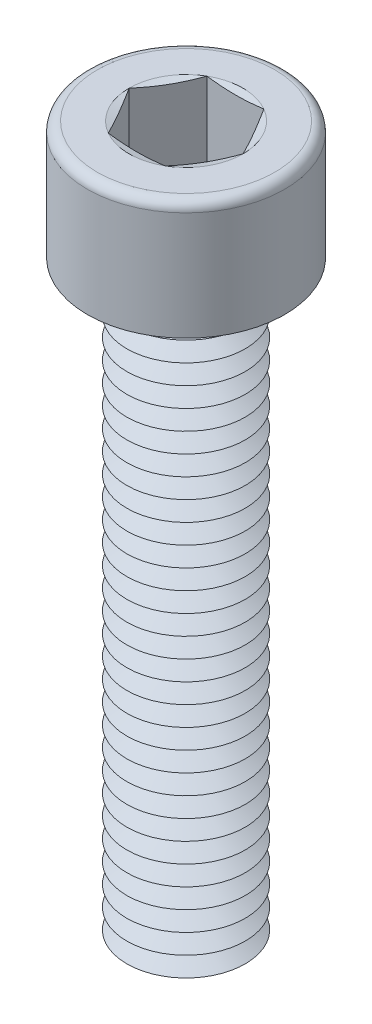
ISO-10303-21;
HEADER;
FILE_DESCRIPTION(('STEP AP214'),'2;1');
FILE_NAME('part.step','',(''),(''),'','','');
FILE_SCHEMA(('AUTOMOTIVE_DESIGN { 1 0 10303 214 1 1 1 1 }'));
ENDSEC;
DATA;
#1=APPLICATION_CONTEXT('core data for automotive mechanical design processes');
#2=APPLICATION_PROTOCOL_DEFINITION('international standard','automotive_design',2000,#1);
#3=PRODUCT_CONTEXT('',#1,'mechanical');
#4=PRODUCT('Part','Part','',(#3));
#5=PRODUCT_RELATED_PRODUCT_CATEGORY('part','',(#4));
#6=PRODUCT_DEFINITION_FORMATION('','',#4);
#7=PRODUCT_DEFINITION_CONTEXT('part definition',#1,'design');
#8=PRODUCT_DEFINITION('design','',#6,#7);
#9=PRODUCT_DEFINITION_SHAPE('','',#8);
#10=(LENGTH_UNIT() NAMED_UNIT(*) SI_UNIT(.MILLI.,.METRE.));
#11=(NAMED_UNIT(*) PLANE_ANGLE_UNIT() SI_UNIT($,.RADIAN.));
#12=(NAMED_UNIT(*) SI_UNIT($,.STERADIAN.) SOLID_ANGLE_UNIT());
#13=UNCERTAINTY_MEASURE_WITH_UNIT(LENGTH_MEASURE(1.E-05),#10,'distance_accuracy_value','');
#14=(GEOMETRIC_REPRESENTATION_CONTEXT(3) GLOBAL_UNCERTAINTY_ASSIGNED_CONTEXT((#13)) GLOBAL_UNIT_ASSIGNED_CONTEXT((#10,
#11,#12)) REPRESENTATION_CONTEXT('',''));
#15=CARTESIAN_POINT('',(0.,0.,0.));
#16=DIRECTION('',(0.,0.,1.));
#17=DIRECTION('',(1.,0.,0.));
#18=AXIS2_PLACEMENT_3D('',#15,#16,#17);
#19=CARTESIAN_POINT('',(0.,4.,0.));
#20=DIRECTION('',(0.,1.,0.));
#21=DIRECTION('',(0.,0.,1.));
#22=AXIS2_PLACEMENT_3D('',#19,#20,#21);
#23=CONICAL_SURFACE('',#22,2.13397459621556,1.0471975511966);
#24=CARTESIAN_POINT('',(0.,4.5,0.));
#25=DIRECTION('',(0.,1.,0.));
#26=DIRECTION('',(0.,0.,1.));
#27=AXIS2_PLACEMENT_3D('',#24,#25,#26);
#28=CIRCLE('',#27,3.);
#29=CARTESIAN_POINT('',(0.,4.5,3.));
#30=VERTEX_POINT('',#29);
#31=EDGE_CURVE('E550',#30,#30,#28,.T.);
#32=ORIENTED_EDGE('',*,*,#31,.F.);
#33=EDGE_LOOP('',(#32));
#34=FACE_BOUND('',#33,.T.);
#35=CARTESIAN_POINT('',(0.,4.,0.));
#36=DIRECTION('',(0.,1.,0.));
#37=DIRECTION('',(0.,0.,1.));
#38=AXIS2_PLACEMENT_3D('',#35,#36,#37);
#39=CIRCLE('',#38,2.13397459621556);
#40=CARTESIAN_POINT('',(0.,4.,2.13397459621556));
#41=VERTEX_POINT('',#40);
#42=EDGE_CURVE('E554',#41,#41,#39,.T.);
#43=ORIENTED_EDGE('',*,*,#42,.T.);
#44=EDGE_LOOP('',(#43));
#45=FACE_BOUND('',#44,.T.);
#46=ADVANCED_FACE('F41',(#34,#45),#23,.T.);
#47=CARTESIAN_POINT('',(0.,3.5,0.));
#48=DIRECTION('',(0.,-1.,0.));
#49=DIRECTION('',(0.,0.,-1.));
#50=AXIS2_PLACEMENT_3D('',#47,#48,#49);
#51=CONICAL_SURFACE('',#50,3.,1.0471975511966);
#52=ORIENTED_EDGE('',*,*,#42,.F.);
#53=EDGE_LOOP('',(#52));
#54=FACE_BOUND('',#53,.T.);
#55=CARTESIAN_POINT('',(0.,3.5,0.));
#56=DIRECTION('',(0.,1.,0.));
#57=DIRECTION('',(0.,0.,1.));
#58=AXIS2_PLACEMENT_3D('',#55,#56,#57);
#59=CIRCLE('',#58,3.);
#60=CARTESIAN_POINT('',(0.,3.5,3.));
#61=VERTEX_POINT('',#60);
#62=EDGE_CURVE('E558',#61,#61,#59,.T.);
#63=ORIENTED_EDGE('',*,*,#62,.T.);
#64=EDGE_LOOP('',(#63));
#65=FACE_BOUND('',#64,.T.);
#66=ADVANCED_FACE('F251',(#54,#65),#51,.T.);
#67=CARTESIAN_POINT('',(0.,0.,0.));
#68=DIRECTION('',(0.,1.,0.));
#69=DIRECTION('',(0.,0.,1.));
#70=AXIS2_PLACEMENT_3D('',#67,#68,#69);
#71=PLANE('',#70);
#72=CARTESIAN_POINT('',(0.,0.,0.));
#73=DIRECTION('',(0.,1.,0.));
#74=DIRECTION('',(0.,0.,1.));
#75=AXIS2_PLACEMENT_3D('',#72,#73,#74);
#76=CIRCLE('',#75,2.13397459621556);
#77=CARTESIAN_POINT('',(0.,0.,2.13397459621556));
#78=VERTEX_POINT('',#77);
#79=EDGE_CURVE('E586',#78,#78,#76,.T.);
#80=ORIENTED_EDGE('',*,*,#79,.F.);
#81=EDGE_LOOP('',(#80));
#82=FACE_BOUND('',#81,.T.);
#83=ADVANCED_FACE('F248',(#82),#71,.F.);
#84=CARTESIAN_POINT('',(0.,0.,0.));
#85=DIRECTION('',(0.,1.,0.));
#86=DIRECTION('',(0.,0.,1.));
#87=AXIS2_PLACEMENT_3D('',#84,#85,#86);
#88=CONICAL_SURFACE('',#87,2.13397459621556,1.0471975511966);
#89=CARTESIAN_POINT('',(0.,0.5,0.));
#90=DIRECTION('',(0.,1.,0.));
#91=DIRECTION('',(0.,0.,1.));
#92=AXIS2_PLACEMENT_3D('',#89,#90,#91);
#93=CIRCLE('',#92,3.);
#94=CARTESIAN_POINT('',(0.,0.5,3.));
#95=VERTEX_POINT('',#94);
#96=EDGE_CURVE('E582',#95,#95,#93,.T.);
#97=ORIENTED_EDGE('',*,*,#96,.F.);
#98=EDGE_LOOP('',(#97));
#99=FACE_BOUND('',#98,.T.);
#100=ORIENTED_EDGE('',*,*,#79,.T.);
#101=EDGE_LOOP('',(#100));
#102=FACE_BOUND('',#101,.T.);
#103=ADVANCED_FACE('F250',(#99,#102),#88,.T.);
#104=CARTESIAN_POINT('',(0.,0.5,0.));
#105=DIRECTION('',(0.,-1.,0.));
#106=DIRECTION('',(0.,0.,-1.));
#107=AXIS2_PLACEMENT_3D('',#104,#105,#106);
#108=CONICAL_SURFACE('',#107,3.,1.0471975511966);
#109=CARTESIAN_POINT('',(0.,1.,0.));
#110=DIRECTION('',(0.,1.,0.));
#111=DIRECTION('',(0.,0.,1.));
#112=AXIS2_PLACEMENT_3D('',#109,#110,#111);
#113=CIRCLE('',#112,2.13397459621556);
#114=CARTESIAN_POINT('',(0.,1.,2.13397459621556));
#115=VERTEX_POINT('',#114);
#116=EDGE_CURVE('E578',#115,#115,#113,.T.);
#117=ORIENTED_EDGE('',*,*,#116,.F.);
#118=EDGE_LOOP('',(#117));
#119=FACE_BOUND('',#118,.T.);
#120=ORIENTED_EDGE('',*,*,#96,.T.);
#121=EDGE_LOOP('',(#120));
#122=FACE_BOUND('',#121,.T.);
#123=ADVANCED_FACE('F291',(#119,#122),#108,.T.);
#124=CARTESIAN_POINT('',(0.,1.,0.));
#125=DIRECTION('',(0.,1.,0.));
#126=DIRECTION('',(0.,0.,1.));
#127=AXIS2_PLACEMENT_3D('',#124,#125,#126);
#128=CONICAL_SURFACE('',#127,2.13397459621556,1.0471975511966);
#129=CARTESIAN_POINT('',(0.,1.5,0.));
#130=DIRECTION('',(0.,1.,0.));
#131=DIRECTION('',(0.,0.,1.));
#132=AXIS2_PLACEMENT_3D('',#129,#130,#131);
#133=CIRCLE('',#132,3.);
#134=CARTESIAN_POINT('',(0.,1.5,3.));
#135=VERTEX_POINT('',#134);
#136=EDGE_CURVE('E574',#135,#135,#133,.T.);
#137=ORIENTED_EDGE('',*,*,#136,.F.);
#138=EDGE_LOOP('',(#137));
#139=FACE_BOUND('',#138,.T.);
#140=ORIENTED_EDGE('',*,*,#116,.T.);
#141=EDGE_LOOP('',(#140));
#142=FACE_BOUND('',#141,.T.);
#143=ADVANCED_FACE('F286',(#139,#142),#128,.T.);
#144=CARTESIAN_POINT('',(0.,1.5,0.));
#145=DIRECTION('',(0.,-1.,0.));
#146=DIRECTION('',(0.,0.,-1.));
#147=AXIS2_PLACEMENT_3D('',#144,#145,#146);
#148=CONICAL_SURFACE('',#147,3.,1.0471975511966);
#149=CARTESIAN_POINT('',(0.,2.,0.));
#150=DIRECTION('',(0.,1.,0.));
#151=DIRECTION('',(0.,0.,1.));
#152=AXIS2_PLACEMENT_3D('',#149,#150,#151);
#153=CIRCLE('',#152,2.13397459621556);
#154=CARTESIAN_POINT('',(0.,2.,2.13397459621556));
#155=VERTEX_POINT('',#154);
#156=EDGE_CURVE('E570',#155,#155,#153,.T.);
#157=ORIENTED_EDGE('',*,*,#156,.F.);
#158=EDGE_LOOP('',(#157));
#159=FACE_BOUND('',#158,.T.);
#160=ORIENTED_EDGE('',*,*,#136,.T.);
#161=EDGE_LOOP('',(#160));
#162=FACE_BOUND('',#161,.T.);
#163=ADVANCED_FACE('F283',(#159,#162),#148,.T.);
#164=CARTESIAN_POINT('',(0.,2.,0.));
#165=DIRECTION('',(0.,1.,0.));
#166=DIRECTION('',(0.,0.,1.));
#167=AXIS2_PLACEMENT_3D('',#164,#165,#166);
#168=CONICAL_SURFACE('',#167,2.13397459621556,1.0471975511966);
#169=CARTESIAN_POINT('',(0.,2.5,0.));
#170=DIRECTION('',(0.,1.,0.));
#171=DIRECTION('',(0.,0.,1.));
#172=AXIS2_PLACEMENT_3D('',#169,#170,#171);
#173=CIRCLE('',#172,3.);
#174=CARTESIAN_POINT('',(0.,2.5,3.));
#175=VERTEX_POINT('',#174);
#176=EDGE_CURVE('E566',#175,#175,#173,.T.);
#177=ORIENTED_EDGE('',*,*,#176,.F.);
#178=EDGE_LOOP('',(#177));
#179=FACE_BOUND('',#178,.T.);
#180=ORIENTED_EDGE('',*,*,#156,.T.);
#181=EDGE_LOOP('',(#180));
#182=FACE_BOUND('',#181,.T.);
#183=ADVANCED_FACE('F277',(#179,#182),#168,.T.);
#184=CARTESIAN_POINT('',(0.,2.5,0.));
#185=DIRECTION('',(0.,-1.,0.));
#186=DIRECTION('',(0.,0.,-1.));
#187=AXIS2_PLACEMENT_3D('',#184,#185,#186);
#188=CONICAL_SURFACE('',#187,3.,1.0471975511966);
#189=CARTESIAN_POINT('',(0.,3.,0.));
#190=DIRECTION('',(0.,1.,0.));
#191=DIRECTION('',(0.,0.,1.));
#192=AXIS2_PLACEMENT_3D('',#189,#190,#191);
#193=CIRCLE('',#192,2.13397459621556);
#194=CARTESIAN_POINT('',(0.,3.,2.13397459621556));
#195=VERTEX_POINT('',#194);
#196=EDGE_CURVE('E562',#195,#195,#193,.T.);
#197=ORIENTED_EDGE('',*,*,#196,.F.);
#198=EDGE_LOOP('',(#197));
#199=FACE_BOUND('',#198,.T.);
#200=ORIENTED_EDGE('',*,*,#176,.T.);
#201=EDGE_LOOP('',(#200));
#202=FACE_BOUND('',#201,.T.);
#203=ADVANCED_FACE('F273',(#199,#202),#188,.T.);
#204=CARTESIAN_POINT('',(0.,3.,0.));
#205=DIRECTION('',(0.,1.,0.));
#206=DIRECTION('',(0.,0.,1.));
#207=AXIS2_PLACEMENT_3D('',#204,#205,#206);
#208=CONICAL_SURFACE('',#207,2.13397459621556,1.0471975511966);
#209=ORIENTED_EDGE('',*,*,#62,.F.);
#210=EDGE_LOOP('',(#209));
#211=FACE_BOUND('',#210,.T.);
#212=ORIENTED_EDGE('',*,*,#196,.T.);
#213=EDGE_LOOP('',(#212));
#214=FACE_BOUND('',#213,.T.);
#215=ADVANCED_FACE('F276',(#211,#214),#208,.T.);
#216=CARTESIAN_POINT('',(0.,5.,0.));
#217=DIRECTION('',(0.,1.,0.));
#218=DIRECTION('',(0.,0.,1.));
#219=AXIS2_PLACEMENT_3D('',#216,#217,#218);
#220=CONICAL_SURFACE('',#219,2.13397459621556,1.0471975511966);
#221=CARTESIAN_POINT('',(0.,5.5,0.));
#222=DIRECTION('',(0.,1.,0.));
#223=DIRECTION('',(0.,0.,1.));
#224=AXIS2_PLACEMENT_3D('',#221,#222,#223);
#225=CIRCLE('',#224,3.);
#226=CARTESIAN_POINT('',(0.,5.5,3.));
#227=VERTEX_POINT('',#226);
#228=EDGE_CURVE('E542',#227,#227,#225,.T.);
#229=ORIENTED_EDGE('',*,*,#228,.F.);
#230=EDGE_LOOP('',(#229));
#231=FACE_BOUND('',#230,.T.);
#232=CARTESIAN_POINT('',(0.,5.,0.));
#233=DIRECTION('',(0.,1.,0.));
#234=DIRECTION('',(0.,0.,1.));
#235=AXIS2_PLACEMENT_3D('',#232,#233,#234);
#236=CIRCLE('',#235,2.13397459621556);
#237=CARTESIAN_POINT('',(0.,5.,2.13397459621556));
#238=VERTEX_POINT('',#237);
#239=EDGE_CURVE('E546',#238,#238,#236,.T.);
#240=ORIENTED_EDGE('',*,*,#239,.T.);
#241=EDGE_LOOP('',(#240));
#242=FACE_BOUND('',#241,.T.);
#243=ADVANCED_FACE('F281',(#231,#242),#220,.T.);
#244=CARTESIAN_POINT('',(0.,4.5,0.));
#245=DIRECTION('',(0.,-1.,0.));
#246=DIRECTION('',(0.,0.,-1.));
#247=AXIS2_PLACEMENT_3D('',#244,#245,#246);
#248=CONICAL_SURFACE('',#247,3.,1.0471975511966);
#249=ORIENTED_EDGE('',*,*,#239,.F.);
#250=EDGE_LOOP('',(#249));
#251=FACE_BOUND('',#250,.T.);
#252=ORIENTED_EDGE('',*,*,#31,.T.);
#253=EDGE_LOOP('',(#252));
#254=FACE_BOUND('',#253,.T.);
#255=ADVANCED_FACE('F830',(#251,#254),#248,.T.);
#256=CARTESIAN_POINT('',(0.,6.,0.));
#257=DIRECTION('',(0.,1.,0.));
#258=DIRECTION('',(0.,0.,1.));
#259=AXIS2_PLACEMENT_3D('',#256,#257,#258);
#260=CONICAL_SURFACE('',#259,2.13397459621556,1.0471975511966);
#261=CARTESIAN_POINT('',(0.,6.5,0.));
#262=DIRECTION('',(0.,1.,0.));
#263=DIRECTION('',(0.,0.,1.));
#264=AXIS2_PLACEMENT_3D('',#261,#262,#263);
#265=CIRCLE('',#264,3.);
#266=CARTESIAN_POINT('',(0.,6.5,3.));
#267=VERTEX_POINT('',#266);
#268=EDGE_CURVE('E534',#267,#267,#265,.T.);
#269=ORIENTED_EDGE('',*,*,#268,.F.);
#270=EDGE_LOOP('',(#269));
#271=FACE_BOUND('',#270,.T.);
#272=CARTESIAN_POINT('',(0.,6.,0.));
#273=DIRECTION('',(0.,1.,0.));
#274=DIRECTION('',(0.,0.,1.));
#275=AXIS2_PLACEMENT_3D('',#272,#273,#274);
#276=CIRCLE('',#275,2.13397459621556);
#277=CARTESIAN_POINT('',(0.,6.,2.13397459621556));
#278=VERTEX_POINT('',#277);
#279=EDGE_CURVE('E538',#278,#278,#276,.T.);
#280=ORIENTED_EDGE('',*,*,#279,.T.);
#281=EDGE_LOOP('',(#280));
#282=FACE_BOUND('',#281,.T.);
#283=ADVANCED_FACE('F839',(#271,#282),#260,.T.);
#284=CARTESIAN_POINT('',(0.,5.5,0.));
#285=DIRECTION('',(0.,-1.,0.));
#286=DIRECTION('',(0.,0.,-1.));
#287=AXIS2_PLACEMENT_3D('',#284,#285,#286);
#288=CONICAL_SURFACE('',#287,3.,1.0471975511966);
#289=ORIENTED_EDGE('',*,*,#279,.F.);
#290=EDGE_LOOP('',(#289));
#291=FACE_BOUND('',#290,.T.);
#292=ORIENTED_EDGE('',*,*,#228,.T.);
#293=EDGE_LOOP('',(#292));
#294=FACE_BOUND('',#293,.T.);
#295=ADVANCED_FACE('F849',(#291,#294),#288,.T.);
#296=CARTESIAN_POINT('',(0.,7.,0.));
#297=DIRECTION('',(0.,1.,0.));
#298=DIRECTION('',(0.,0.,1.));
#299=AXIS2_PLACEMENT_3D('',#296,#297,#298);
#300=CONICAL_SURFACE('',#299,2.13397459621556,1.0471975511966);
#301=CARTESIAN_POINT('',(0.,7.5,0.));
#302=DIRECTION('',(0.,1.,0.));
#303=DIRECTION('',(0.,0.,1.));
#304=AXIS2_PLACEMENT_3D('',#301,#302,#303);
#305=CIRCLE('',#304,3.);
#306=CARTESIAN_POINT('',(0.,7.5,3.));
#307=VERTEX_POINT('',#306);
#308=EDGE_CURVE('E526',#307,#307,#305,.T.);
#309=ORIENTED_EDGE('',*,*,#308,.F.);
#310=EDGE_LOOP('',(#309));
#311=FACE_BOUND('',#310,.T.);
#312=CARTESIAN_POINT('',(0.,7.,0.));
#313=DIRECTION('',(0.,1.,0.));
#314=DIRECTION('',(0.,0.,1.));
#315=AXIS2_PLACEMENT_3D('',#312,#313,#314);
#316=CIRCLE('',#315,2.13397459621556);
#317=CARTESIAN_POINT('',(0.,7.,2.13397459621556));
#318=VERTEX_POINT('',#317);
#319=EDGE_CURVE('E530',#318,#318,#316,.T.);
#320=ORIENTED_EDGE('',*,*,#319,.T.);
#321=EDGE_LOOP('',(#320));
#322=FACE_BOUND('',#321,.T.);
#323=ADVANCED_FACE('F859',(#311,#322),#300,.T.);
#324=CARTESIAN_POINT('',(0.,6.5,0.));
#325=DIRECTION('',(0.,-1.,0.));
#326=DIRECTION('',(0.,0.,-1.));
#327=AXIS2_PLACEMENT_3D('',#324,#325,#326);
#328=CONICAL_SURFACE('',#327,3.,1.0471975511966);
#329=ORIENTED_EDGE('',*,*,#319,.F.);
#330=EDGE_LOOP('',(#329));
#331=FACE_BOUND('',#330,.T.);
#332=ORIENTED_EDGE('',*,*,#268,.T.);
#333=EDGE_LOOP('',(#332));
#334=FACE_BOUND('',#333,.T.);
#335=ADVANCED_FACE('F869',(#331,#334),#328,.T.);
#336=CARTESIAN_POINT('',(0.,8.,0.));
#337=DIRECTION('',(0.,1.,0.));
#338=DIRECTION('',(0.,0.,1.));
#339=AXIS2_PLACEMENT_3D('',#336,#337,#338);
#340=CONICAL_SURFACE('',#339,2.13397459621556,1.0471975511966);
#341=CARTESIAN_POINT('',(0.,8.5,0.));
#342=DIRECTION('',(0.,1.,0.));
#343=DIRECTION('',(0.,0.,1.));
#344=AXIS2_PLACEMENT_3D('',#341,#342,#343);
#345=CIRCLE('',#344,3.);
#346=CARTESIAN_POINT('',(0.,8.5,3.));
#347=VERTEX_POINT('',#346);
#348=EDGE_CURVE('E518',#347,#347,#345,.T.);
#349=ORIENTED_EDGE('',*,*,#348,.F.);
#350=EDGE_LOOP('',(#349));
#351=FACE_BOUND('',#350,.T.);
#352=CARTESIAN_POINT('',(0.,8.,0.));
#353=DIRECTION('',(0.,1.,0.));
#354=DIRECTION('',(0.,0.,1.));
#355=AXIS2_PLACEMENT_3D('',#352,#353,#354);
#356=CIRCLE('',#355,2.13397459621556);
#357=CARTESIAN_POINT('',(0.,8.,2.13397459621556));
#358=VERTEX_POINT('',#357);
#359=EDGE_CURVE('E522',#358,#358,#356,.T.);
#360=ORIENTED_EDGE('',*,*,#359,.T.);
#361=EDGE_LOOP('',(#360));
#362=FACE_BOUND('',#361,.T.);
#363=ADVANCED_FACE('F879',(#351,#362),#340,.T.);
#364=CARTESIAN_POINT('',(0.,7.5,0.));
#365=DIRECTION('',(0.,-1.,0.));
#366=DIRECTION('',(0.,0.,-1.));
#367=AXIS2_PLACEMENT_3D('',#364,#365,#366);
#368=CONICAL_SURFACE('',#367,3.,1.0471975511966);
#369=ORIENTED_EDGE('',*,*,#359,.F.);
#370=EDGE_LOOP('',(#369));
#371=FACE_BOUND('',#370,.T.);
#372=ORIENTED_EDGE('',*,*,#308,.T.);
#373=EDGE_LOOP('',(#372));
#374=FACE_BOUND('',#373,.T.);
#375=ADVANCED_FACE('F889',(#371,#374),#368,.T.);
#376=CARTESIAN_POINT('',(0.,9.,0.));
#377=DIRECTION('',(0.,1.,0.));
#378=DIRECTION('',(0.,0.,1.));
#379=AXIS2_PLACEMENT_3D('',#376,#377,#378);
#380=CONICAL_SURFACE('',#379,2.13397459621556,1.0471975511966);
#381=CARTESIAN_POINT('',(0.,9.5,0.));
#382=DIRECTION('',(0.,1.,0.));
#383=DIRECTION('',(0.,0.,1.));
#384=AXIS2_PLACEMENT_3D('',#381,#382,#383);
#385=CIRCLE('',#384,3.);
#386=CARTESIAN_POINT('',(0.,9.5,3.));
#387=VERTEX_POINT('',#386);
#388=EDGE_CURVE('E510',#387,#387,#385,.T.);
#389=ORIENTED_EDGE('',*,*,#388,.F.);
#390=EDGE_LOOP('',(#389));
#391=FACE_BOUND('',#390,.T.);
#392=CARTESIAN_POINT('',(0.,9.,0.));
#393=DIRECTION('',(0.,1.,0.));
#394=DIRECTION('',(0.,0.,1.));
#395=AXIS2_PLACEMENT_3D('',#392,#393,#394);
#396=CIRCLE('',#395,2.13397459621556);
#397=CARTESIAN_POINT('',(0.,9.,2.13397459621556));
#398=VERTEX_POINT('',#397);
#399=EDGE_CURVE('E514',#398,#398,#396,.T.);
#400=ORIENTED_EDGE('',*,*,#399,.T.);
#401=EDGE_LOOP('',(#400));
#402=FACE_BOUND('',#401,.T.);
#403=ADVANCED_FACE('F899',(#391,#402),#380,.T.);
#404=CARTESIAN_POINT('',(0.,8.5,0.));
#405=DIRECTION('',(0.,-1.,0.));
#406=DIRECTION('',(0.,0.,-1.));
#407=AXIS2_PLACEMENT_3D('',#404,#405,#406);
#408=CONICAL_SURFACE('',#407,3.,1.0471975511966);
#409=ORIENTED_EDGE('',*,*,#399,.F.);
#410=EDGE_LOOP('',(#409));
#411=FACE_BOUND('',#410,.T.);
#412=ORIENTED_EDGE('',*,*,#348,.T.);
#413=EDGE_LOOP('',(#412));
#414=FACE_BOUND('',#413,.T.);
#415=ADVANCED_FACE('F909',(#411,#414),#408,.T.);
#416=CARTESIAN_POINT('',(0.,10.,0.));
#417=DIRECTION('',(0.,1.,0.));
#418=DIRECTION('',(0.,0.,1.));
#419=AXIS2_PLACEMENT_3D('',#416,#417,#418);
#420=CONICAL_SURFACE('',#419,2.13397459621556,1.0471975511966);
#421=CARTESIAN_POINT('',(0.,10.5,0.));
#422=DIRECTION('',(0.,1.,0.));
#423=DIRECTION('',(0.,0.,1.));
#424=AXIS2_PLACEMENT_3D('',#421,#422,#423);
#425=CIRCLE('',#424,3.);
#426=CARTESIAN_POINT('',(0.,10.5,3.));
#427=VERTEX_POINT('',#426);
#428=EDGE_CURVE('E502',#427,#427,#425,.T.);
#429=ORIENTED_EDGE('',*,*,#428,.F.);
#430=EDGE_LOOP('',(#429));
#431=FACE_BOUND('',#430,.T.);
#432=CARTESIAN_POINT('',(0.,10.,0.));
#433=DIRECTION('',(0.,1.,0.));
#434=DIRECTION('',(0.,0.,1.));
#435=AXIS2_PLACEMENT_3D('',#432,#433,#434);
#436=CIRCLE('',#435,2.13397459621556);
#437=CARTESIAN_POINT('',(0.,10.,2.13397459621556));
#438=VERTEX_POINT('',#437);
#439=EDGE_CURVE('E506',#438,#438,#436,.T.);
#440=ORIENTED_EDGE('',*,*,#439,.T.);
#441=EDGE_LOOP('',(#440));
#442=FACE_BOUND('',#441,.T.);
#443=ADVANCED_FACE('F919',(#431,#442),#420,.T.);
#444=CARTESIAN_POINT('',(0.,9.5,0.));
#445=DIRECTION('',(0.,-1.,0.));
#446=DIRECTION('',(0.,0.,-1.));
#447=AXIS2_PLACEMENT_3D('',#444,#445,#446);
#448=CONICAL_SURFACE('',#447,3.,1.0471975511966);
#449=ORIENTED_EDGE('',*,*,#439,.F.);
#450=EDGE_LOOP('',(#449));
#451=FACE_BOUND('',#450,.T.);
#452=ORIENTED_EDGE('',*,*,#388,.T.);
#453=EDGE_LOOP('',(#452));
#454=FACE_BOUND('',#453,.T.);
#455=ADVANCED_FACE('F929',(#451,#454),#448,.T.);
#456=CARTESIAN_POINT('',(0.,11.,0.));
#457=DIRECTION('',(0.,1.,0.));
#458=DIRECTION('',(0.,0.,1.));
#459=AXIS2_PLACEMENT_3D('',#456,#457,#458);
#460=CONICAL_SURFACE('',#459,2.13397459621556,1.0471975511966);
#461=CARTESIAN_POINT('',(0.,11.5,0.));
#462=DIRECTION('',(0.,1.,0.));
#463=DIRECTION('',(0.,0.,1.));
#464=AXIS2_PLACEMENT_3D('',#461,#462,#463);
#465=CIRCLE('',#464,3.);
#466=CARTESIAN_POINT('',(0.,11.5,3.));
#467=VERTEX_POINT('',#466);
#468=EDGE_CURVE('E495',#467,#467,#465,.T.);
#469=ORIENTED_EDGE('',*,*,#468,.F.);
#470=EDGE_LOOP('',(#469));
#471=FACE_BOUND('',#470,.T.);
#472=CARTESIAN_POINT('',(0.,11.,0.));
#473=DIRECTION('',(0.,1.,0.));
#474=DIRECTION('',(0.,0.,1.));
#475=AXIS2_PLACEMENT_3D('',#472,#473,#474);
#476=CIRCLE('',#475,2.13397459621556);
#477=CARTESIAN_POINT('',(0.,11.,2.13397459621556));
#478=VERTEX_POINT('',#477);
#479=EDGE_CURVE('E498',#478,#478,#476,.T.);
#480=ORIENTED_EDGE('',*,*,#479,.T.);
#481=EDGE_LOOP('',(#480));
#482=FACE_BOUND('',#481,.T.);
#483=ADVANCED_FACE('F939',(#471,#482),#460,.T.);
#484=CARTESIAN_POINT('',(0.,10.5,0.));
#485=DIRECTION('',(0.,-1.,0.));
#486=DIRECTION('',(0.,0.,-1.));
#487=AXIS2_PLACEMENT_3D('',#484,#485,#486);
#488=CONICAL_SURFACE('',#487,3.,1.0471975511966);
#489=ORIENTED_EDGE('',*,*,#479,.F.);
#490=EDGE_LOOP('',(#489));
#491=FACE_BOUND('',#490,.T.);
#492=ORIENTED_EDGE('',*,*,#428,.T.);
#493=EDGE_LOOP('',(#492));
#494=FACE_BOUND('',#493,.T.);
#495=ADVANCED_FACE('F949',(#491,#494),#488,.T.);
#496=CARTESIAN_POINT('',(0.,12.,0.));
#497=DIRECTION('',(0.,1.,0.));
#498=DIRECTION('',(0.,0.,1.));
#499=AXIS2_PLACEMENT_3D('',#496,#497,#498);
#500=CONICAL_SURFACE('',#499,2.13397459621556,1.0471975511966);
#501=CARTESIAN_POINT('',(0.,12.5,0.));
#502=DIRECTION('',(0.,1.,0.));
#503=DIRECTION('',(0.,0.,1.));
#504=AXIS2_PLACEMENT_3D('',#501,#502,#503);
#505=CIRCLE('',#504,3.);
#506=CARTESIAN_POINT('',(0.,12.5,3.));
#507=VERTEX_POINT('',#506);
#508=EDGE_CURVE('E487',#507,#507,#505,.T.);
#509=ORIENTED_EDGE('',*,*,#508,.F.);
#510=EDGE_LOOP('',(#509));
#511=FACE_BOUND('',#510,.T.);
#512=CARTESIAN_POINT('',(0.,12.,0.));
#513=DIRECTION('',(0.,1.,0.));
#514=DIRECTION('',(0.,0.,1.));
#515=AXIS2_PLACEMENT_3D('',#512,#513,#514);
#516=CIRCLE('',#515,2.13397459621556);
#517=CARTESIAN_POINT('',(0.,12.,2.13397459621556));
#518=VERTEX_POINT('',#517);
#519=EDGE_CURVE('E491',#518,#518,#516,.T.);
#520=ORIENTED_EDGE('',*,*,#519,.T.);
#521=EDGE_LOOP('',(#520));
#522=FACE_BOUND('',#521,.T.);
#523=ADVANCED_FACE('F959',(#511,#522),#500,.T.);
#524=CARTESIAN_POINT('',(0.,11.5,0.));
#525=DIRECTION('',(0.,-1.,0.));
#526=DIRECTION('',(0.,0.,-1.));
#527=AXIS2_PLACEMENT_3D('',#524,#525,#526);
#528=CONICAL_SURFACE('',#527,3.,1.0471975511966);
#529=ORIENTED_EDGE('',*,*,#519,.F.);
#530=EDGE_LOOP('',(#529));
#531=FACE_BOUND('',#530,.T.);
#532=ORIENTED_EDGE('',*,*,#468,.T.);
#533=EDGE_LOOP('',(#532));
#534=FACE_BOUND('',#533,.T.);
#535=ADVANCED_FACE('F969',(#531,#534),#528,.T.);
#536=CARTESIAN_POINT('',(0.,13.,0.));
#537=DIRECTION('',(0.,1.,0.));
#538=DIRECTION('',(0.,0.,1.));
#539=AXIS2_PLACEMENT_3D('',#536,#537,#538);
#540=CONICAL_SURFACE('',#539,2.13397459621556,1.0471975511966);
#541=CARTESIAN_POINT('',(0.,13.5,0.));
#542=DIRECTION('',(0.,1.,0.));
#543=DIRECTION('',(0.,0.,1.));
#544=AXIS2_PLACEMENT_3D('',#541,#542,#543);
#545=CIRCLE('',#544,3.);
#546=CARTESIAN_POINT('',(0.,13.5,3.));
#547=VERTEX_POINT('',#546);
#548=EDGE_CURVE('E479',#547,#547,#545,.T.);
#549=ORIENTED_EDGE('',*,*,#548,.F.);
#550=EDGE_LOOP('',(#549));
#551=FACE_BOUND('',#550,.T.);
#552=CARTESIAN_POINT('',(0.,13.,0.));
#553=DIRECTION('',(0.,1.,0.));
#554=DIRECTION('',(0.,0.,1.));
#555=AXIS2_PLACEMENT_3D('',#552,#553,#554);
#556=CIRCLE('',#555,2.13397459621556);
#557=CARTESIAN_POINT('',(0.,13.,2.13397459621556));
#558=VERTEX_POINT('',#557);
#559=EDGE_CURVE('E483',#558,#558,#556,.T.);
#560=ORIENTED_EDGE('',*,*,#559,.T.);
#561=EDGE_LOOP('',(#560));
#562=FACE_BOUND('',#561,.T.);
#563=ADVANCED_FACE('F979',(#551,#562),#540,.T.);
#564=CARTESIAN_POINT('',(0.,12.5,0.));
#565=DIRECTION('',(0.,-1.,0.));
#566=DIRECTION('',(0.,0.,-1.));
#567=AXIS2_PLACEMENT_3D('',#564,#565,#566);
#568=CONICAL_SURFACE('',#567,3.,1.0471975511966);
#569=ORIENTED_EDGE('',*,*,#559,.F.);
#570=EDGE_LOOP('',(#569));
#571=FACE_BOUND('',#570,.T.);
#572=ORIENTED_EDGE('',*,*,#508,.T.);
#573=EDGE_LOOP('',(#572));
#574=FACE_BOUND('',#573,.T.);
#575=ADVANCED_FACE('F989',(#571,#574),#568,.T.);
#576=CARTESIAN_POINT('',(0.,14.,0.));
#577=DIRECTION('',(0.,1.,0.));
#578=DIRECTION('',(0.,0.,1.));
#579=AXIS2_PLACEMENT_3D('',#576,#577,#578);
#580=CONICAL_SURFACE('',#579,2.13397459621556,1.0471975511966);
#581=CARTESIAN_POINT('',(0.,14.5,0.));
#582=DIRECTION('',(0.,1.,0.));
#583=DIRECTION('',(0.,0.,1.));
#584=AXIS2_PLACEMENT_3D('',#581,#582,#583);
#585=CIRCLE('',#584,3.);
#586=CARTESIAN_POINT('',(0.,14.5,3.));
#587=VERTEX_POINT('',#586);
#588=EDGE_CURVE('E471',#587,#587,#585,.T.);
#589=ORIENTED_EDGE('',*,*,#588,.F.);
#590=EDGE_LOOP('',(#589));
#591=FACE_BOUND('',#590,.T.);
#592=CARTESIAN_POINT('',(0.,14.,0.));
#593=DIRECTION('',(0.,1.,0.));
#594=DIRECTION('',(0.,0.,1.));
#595=AXIS2_PLACEMENT_3D('',#592,#593,#594);
#596=CIRCLE('',#595,2.13397459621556);
#597=CARTESIAN_POINT('',(0.,14.,2.13397459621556));
#598=VERTEX_POINT('',#597);
#599=EDGE_CURVE('E475',#598,#598,#596,.T.);
#600=ORIENTED_EDGE('',*,*,#599,.T.);
#601=EDGE_LOOP('',(#600));
#602=FACE_BOUND('',#601,.T.);
#603=ADVANCED_FACE('F999',(#591,#602),#580,.T.);
#604=CARTESIAN_POINT('',(0.,13.5,0.));
#605=DIRECTION('',(0.,-1.,0.));
#606=DIRECTION('',(0.,0.,-1.));
#607=AXIS2_PLACEMENT_3D('',#604,#605,#606);
#608=CONICAL_SURFACE('',#607,3.,1.0471975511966);
#609=ORIENTED_EDGE('',*,*,#599,.F.);
#610=EDGE_LOOP('',(#609));
#611=FACE_BOUND('',#610,.T.);
#612=ORIENTED_EDGE('',*,*,#548,.T.);
#613=EDGE_LOOP('',(#612));
#614=FACE_BOUND('',#613,.T.);
#615=ADVANCED_FACE('F1009',(#611,#614),#608,.T.);
#616=CARTESIAN_POINT('',(0.,15.,0.));
#617=DIRECTION('',(0.,1.,0.));
#618=DIRECTION('',(0.,0.,1.));
#619=AXIS2_PLACEMENT_3D('',#616,#617,#618);
#620=CONICAL_SURFACE('',#619,2.13397459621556,1.0471975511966);
#621=CARTESIAN_POINT('',(0.,15.5,0.));
#622=DIRECTION('',(0.,1.,0.));
#623=DIRECTION('',(0.,0.,1.));
#624=AXIS2_PLACEMENT_3D('',#621,#622,#623);
#625=CIRCLE('',#624,3.);
#626=CARTESIAN_POINT('',(0.,15.5,3.));
#627=VERTEX_POINT('',#626);
#628=EDGE_CURVE('E463',#627,#627,#625,.T.);
#629=ORIENTED_EDGE('',*,*,#628,.F.);
#630=EDGE_LOOP('',(#629));
#631=FACE_BOUND('',#630,.T.);
#632=CARTESIAN_POINT('',(0.,15.,0.));
#633=DIRECTION('',(0.,1.,0.));
#634=DIRECTION('',(0.,0.,1.));
#635=AXIS2_PLACEMENT_3D('',#632,#633,#634);
#636=CIRCLE('',#635,2.13397459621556);
#637=CARTESIAN_POINT('',(0.,15.,2.13397459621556));
#638=VERTEX_POINT('',#637);
#639=EDGE_CURVE('E467',#638,#638,#636,.T.);
#640=ORIENTED_EDGE('',*,*,#639,.T.);
#641=EDGE_LOOP('',(#640));
#642=FACE_BOUND('',#641,.T.);
#643=ADVANCED_FACE('F1019',(#631,#642),#620,.T.);
#644=CARTESIAN_POINT('',(0.,14.5,0.));
#645=DIRECTION('',(0.,-1.,0.));
#646=DIRECTION('',(0.,0.,-1.));
#647=AXIS2_PLACEMENT_3D('',#644,#645,#646);
#648=CONICAL_SURFACE('',#647,3.,1.0471975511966);
#649=ORIENTED_EDGE('',*,*,#639,.F.);
#650=EDGE_LOOP('',(#649));
#651=FACE_BOUND('',#650,.T.);
#652=ORIENTED_EDGE('',*,*,#588,.T.);
#653=EDGE_LOOP('',(#652));
#654=FACE_BOUND('',#653,.T.);
#655=ADVANCED_FACE('F1029',(#651,#654),#648,.T.);
#656=CARTESIAN_POINT('',(0.,16.,0.));
#657=DIRECTION('',(0.,1.,0.));
#658=DIRECTION('',(0.,0.,1.));
#659=AXIS2_PLACEMENT_3D('',#656,#657,#658);
#660=CONICAL_SURFACE('',#659,2.13397459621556,1.0471975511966);
#661=CARTESIAN_POINT('',(0.,16.5,0.));
#662=DIRECTION('',(0.,1.,0.));
#663=DIRECTION('',(0.,0.,1.));
#664=AXIS2_PLACEMENT_3D('',#661,#662,#663);
#665=CIRCLE('',#664,3.);
#666=CARTESIAN_POINT('',(0.,16.5,3.));
#667=VERTEX_POINT('',#666);
#668=EDGE_CURVE('E455',#667,#667,#665,.T.);
#669=ORIENTED_EDGE('',*,*,#668,.F.);
#670=EDGE_LOOP('',(#669));
#671=FACE_BOUND('',#670,.T.);
#672=CARTESIAN_POINT('',(0.,16.,0.));
#673=DIRECTION('',(0.,1.,0.));
#674=DIRECTION('',(0.,0.,1.));
#675=AXIS2_PLACEMENT_3D('',#672,#673,#674);
#676=CIRCLE('',#675,2.13397459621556);
#677=CARTESIAN_POINT('',(0.,16.,2.13397459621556));
#678=VERTEX_POINT('',#677);
#679=EDGE_CURVE('E459',#678,#678,#676,.T.);
#680=ORIENTED_EDGE('',*,*,#679,.T.);
#681=EDGE_LOOP('',(#680));
#682=FACE_BOUND('',#681,.T.);
#683=ADVANCED_FACE('F1039',(#671,#682),#660,.T.);
#684=CARTESIAN_POINT('',(0.,15.5,0.));
#685=DIRECTION('',(0.,-1.,0.));
#686=DIRECTION('',(0.,0.,-1.));
#687=AXIS2_PLACEMENT_3D('',#684,#685,#686);
#688=CONICAL_SURFACE('',#687,3.,1.0471975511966);
#689=ORIENTED_EDGE('',*,*,#679,.F.);
#690=EDGE_LOOP('',(#689));
#691=FACE_BOUND('',#690,.T.);
#692=ORIENTED_EDGE('',*,*,#628,.T.);
#693=EDGE_LOOP('',(#692));
#694=FACE_BOUND('',#693,.T.);
#695=ADVANCED_FACE('F1049',(#691,#694),#688,.T.);
#696=CARTESIAN_POINT('',(0.,17.,0.));
#697=DIRECTION('',(0.,1.,0.));
#698=DIRECTION('',(0.,0.,1.));
#699=AXIS2_PLACEMENT_3D('',#696,#697,#698);
#700=CONICAL_SURFACE('',#699,2.13397459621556,1.0471975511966);
#701=CARTESIAN_POINT('',(0.,17.5,0.));
#702=DIRECTION('',(0.,1.,0.));
#703=DIRECTION('',(0.,0.,1.));
#704=AXIS2_PLACEMENT_3D('',#701,#702,#703);
#705=CIRCLE('',#704,3.);
#706=CARTESIAN_POINT('',(0.,17.5,3.));
#707=VERTEX_POINT('',#706);
#708=EDGE_CURVE('E447',#707,#707,#705,.T.);
#709=ORIENTED_EDGE('',*,*,#708,.F.);
#710=EDGE_LOOP('',(#709));
#711=FACE_BOUND('',#710,.T.);
#712=CARTESIAN_POINT('',(0.,17.,0.));
#713=DIRECTION('',(0.,1.,0.));
#714=DIRECTION('',(0.,0.,1.));
#715=AXIS2_PLACEMENT_3D('',#712,#713,#714);
#716=CIRCLE('',#715,2.13397459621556);
#717=CARTESIAN_POINT('',(0.,17.,2.13397459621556));
#718=VERTEX_POINT('',#717);
#719=EDGE_CURVE('E451',#718,#718,#716,.T.);
#720=ORIENTED_EDGE('',*,*,#719,.T.);
#721=EDGE_LOOP('',(#720));
#722=FACE_BOUND('',#721,.T.);
#723=ADVANCED_FACE('F1059',(#711,#722),#700,.T.);
#724=CARTESIAN_POINT('',(0.,16.5,0.));
#725=DIRECTION('',(0.,-1.,0.));
#726=DIRECTION('',(0.,0.,-1.));
#727=AXIS2_PLACEMENT_3D('',#724,#725,#726);
#728=CONICAL_SURFACE('',#727,3.,1.0471975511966);
#729=ORIENTED_EDGE('',*,*,#719,.F.);
#730=EDGE_LOOP('',(#729));
#731=FACE_BOUND('',#730,.T.);
#732=ORIENTED_EDGE('',*,*,#668,.T.);
#733=EDGE_LOOP('',(#732));
#734=FACE_BOUND('',#733,.T.);
#735=ADVANCED_FACE('F1069',(#731,#734),#728,.T.);
#736=CARTESIAN_POINT('',(0.,18.,0.));
#737=DIRECTION('',(0.,1.,0.));
#738=DIRECTION('',(0.,0.,1.));
#739=AXIS2_PLACEMENT_3D('',#736,#737,#738);
#740=CONICAL_SURFACE('',#739,2.13397459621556,1.0471975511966);
#741=CARTESIAN_POINT('',(0.,18.5,0.));
#742=DIRECTION('',(0.,1.,0.));
#743=DIRECTION('',(0.,0.,1.));
#744=AXIS2_PLACEMENT_3D('',#741,#742,#743);
#745=CIRCLE('',#744,3.);
#746=CARTESIAN_POINT('',(0.,18.5,3.));
#747=VERTEX_POINT('',#746);
#748=EDGE_CURVE('E439',#747,#747,#745,.T.);
#749=ORIENTED_EDGE('',*,*,#748,.F.);
#750=EDGE_LOOP('',(#749));
#751=FACE_BOUND('',#750,.T.);
#752=CARTESIAN_POINT('',(0.,18.,0.));
#753=DIRECTION('',(0.,1.,0.));
#754=DIRECTION('',(0.,0.,1.));
#755=AXIS2_PLACEMENT_3D('',#752,#753,#754);
#756=CIRCLE('',#755,2.13397459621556);
#757=CARTESIAN_POINT('',(0.,18.,2.13397459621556));
#758=VERTEX_POINT('',#757);
#759=EDGE_CURVE('E443',#758,#758,#756,.T.);
#760=ORIENTED_EDGE('',*,*,#759,.T.);
#761=EDGE_LOOP('',(#760));
#762=FACE_BOUND('',#761,.T.);
#763=ADVANCED_FACE('F1079',(#751,#762),#740,.T.);
#764=CARTESIAN_POINT('',(0.,17.5,0.));
#765=DIRECTION('',(0.,-1.,0.));
#766=DIRECTION('',(0.,0.,-1.));
#767=AXIS2_PLACEMENT_3D('',#764,#765,#766);
#768=CONICAL_SURFACE('',#767,3.,1.0471975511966);
#769=ORIENTED_EDGE('',*,*,#759,.F.);
#770=EDGE_LOOP('',(#769));
#771=FACE_BOUND('',#770,.T.);
#772=ORIENTED_EDGE('',*,*,#708,.T.);
#773=EDGE_LOOP('',(#772));
#774=FACE_BOUND('',#773,.T.);
#775=ADVANCED_FACE('F1089',(#771,#774),#768,.T.);
#776=CARTESIAN_POINT('',(0.,19.,0.));
#777=DIRECTION('',(0.,1.,0.));
#778=DIRECTION('',(0.,0.,1.));
#779=AXIS2_PLACEMENT_3D('',#776,#777,#778);
#780=CONICAL_SURFACE('',#779,2.13397459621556,1.0471975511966);
#781=CARTESIAN_POINT('',(0.,19.5,0.));
#782=DIRECTION('',(0.,1.,0.));
#783=DIRECTION('',(0.,0.,1.));
#784=AXIS2_PLACEMENT_3D('',#781,#782,#783);
#785=CIRCLE('',#784,3.);
#786=CARTESIAN_POINT('',(0.,19.5,3.));
#787=VERTEX_POINT('',#786);
#788=EDGE_CURVE('E431',#787,#787,#785,.T.);
#789=ORIENTED_EDGE('',*,*,#788,.F.);
#790=EDGE_LOOP('',(#789));
#791=FACE_BOUND('',#790,.T.);
#792=CARTESIAN_POINT('',(0.,19.,0.));
#793=DIRECTION('',(0.,1.,0.));
#794=DIRECTION('',(0.,0.,1.));
#795=AXIS2_PLACEMENT_3D('',#792,#793,#794);
#796=CIRCLE('',#795,2.13397459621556);
#797=CARTESIAN_POINT('',(0.,19.,2.13397459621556));
#798=VERTEX_POINT('',#797);
#799=EDGE_CURVE('E435',#798,#798,#796,.T.);
#800=ORIENTED_EDGE('',*,*,#799,.T.);
#801=EDGE_LOOP('',(#800));
#802=FACE_BOUND('',#801,.T.);
#803=ADVANCED_FACE('F1099',(#791,#802),#780,.T.);
#804=CARTESIAN_POINT('',(0.,18.5,0.));
#805=DIRECTION('',(0.,-1.,0.));
#806=DIRECTION('',(0.,0.,-1.));
#807=AXIS2_PLACEMENT_3D('',#804,#805,#806);
#808=CONICAL_SURFACE('',#807,3.,1.0471975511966);
#809=ORIENTED_EDGE('',*,*,#799,.F.);
#810=EDGE_LOOP('',(#809));
#811=FACE_BOUND('',#810,.T.);
#812=ORIENTED_EDGE('',*,*,#748,.T.);
#813=EDGE_LOOP('',(#812));
#814=FACE_BOUND('',#813,.T.);
#815=ADVANCED_FACE('F1109',(#811,#814),#808,.T.);
#816=CARTESIAN_POINT('',(0.,20.,0.));
#817=DIRECTION('',(0.,1.,0.));
#818=DIRECTION('',(0.,0.,1.));
#819=AXIS2_PLACEMENT_3D('',#816,#817,#818);
#820=CONICAL_SURFACE('',#819,2.13397459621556,1.0471975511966);
#821=CARTESIAN_POINT('',(0.,20.5,0.));
#822=DIRECTION('',(0.,1.,0.));
#823=DIRECTION('',(0.,0.,1.));
#824=AXIS2_PLACEMENT_3D('',#821,#822,#823);
#825=CIRCLE('',#824,3.);
#826=CARTESIAN_POINT('',(0.,20.5,3.));
#827=VERTEX_POINT('',#826);
#828=EDGE_CURVE('E423',#827,#827,#825,.T.);
#829=ORIENTED_EDGE('',*,*,#828,.F.);
#830=EDGE_LOOP('',(#829));
#831=FACE_BOUND('',#830,.T.);
#832=CARTESIAN_POINT('',(0.,20.,0.));
#833=DIRECTION('',(0.,1.,0.));
#834=DIRECTION('',(0.,0.,1.));
#835=AXIS2_PLACEMENT_3D('',#832,#833,#834);
#836=CIRCLE('',#835,2.13397459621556);
#837=CARTESIAN_POINT('',(0.,20.,2.13397459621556));
#838=VERTEX_POINT('',#837);
#839=EDGE_CURVE('E427',#838,#838,#836,.T.);
#840=ORIENTED_EDGE('',*,*,#839,.T.);
#841=EDGE_LOOP('',(#840));
#842=FACE_BOUND('',#841,.T.);
#843=ADVANCED_FACE('F1119',(#831,#842),#820,.T.);
#844=CARTESIAN_POINT('',(0.,19.5,0.));
#845=DIRECTION('',(0.,-1.,0.));
#846=DIRECTION('',(0.,0.,-1.));
#847=AXIS2_PLACEMENT_3D('',#844,#845,#846);
#848=CONICAL_SURFACE('',#847,3.,1.0471975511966);
#849=ORIENTED_EDGE('',*,*,#839,.F.);
#850=EDGE_LOOP('',(#849));
#851=FACE_BOUND('',#850,.T.);
#852=ORIENTED_EDGE('',*,*,#788,.T.);
#853=EDGE_LOOP('',(#852));
#854=FACE_BOUND('',#853,.T.);
#855=ADVANCED_FACE('F1129',(#851,#854),#848,.T.);
#856=CARTESIAN_POINT('',(0.,21.,0.));
#857=DIRECTION('',(0.,1.,0.));
#858=DIRECTION('',(0.,0.,1.));
#859=AXIS2_PLACEMENT_3D('',#856,#857,#858);
#860=CONICAL_SURFACE('',#859,2.13397459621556,1.0471975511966);
#861=CARTESIAN_POINT('',(0.,21.5,0.));
#862=DIRECTION('',(0.,1.,0.));
#863=DIRECTION('',(0.,0.,1.));
#864=AXIS2_PLACEMENT_3D('',#861,#862,#863);
#865=CIRCLE('',#864,3.);
#866=CARTESIAN_POINT('',(0.,21.5,3.));
#867=VERTEX_POINT('',#866);
#868=EDGE_CURVE('E416',#867,#867,#865,.T.);
#869=ORIENTED_EDGE('',*,*,#868,.F.);
#870=EDGE_LOOP('',(#869));
#871=FACE_BOUND('',#870,.T.);
#872=CARTESIAN_POINT('',(0.,21.,0.));
#873=DIRECTION('',(0.,1.,0.));
#874=DIRECTION('',(0.,0.,1.));
#875=AXIS2_PLACEMENT_3D('',#872,#873,#874);
#876=CIRCLE('',#875,2.13397459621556);
#877=CARTESIAN_POINT('',(0.,21.,2.13397459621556));
#878=VERTEX_POINT('',#877);
#879=EDGE_CURVE('E420',#878,#878,#876,.T.);
#880=ORIENTED_EDGE('',*,*,#879,.T.);
#881=EDGE_LOOP('',(#880));
#882=FACE_BOUND('',#881,.T.);
#883=ADVANCED_FACE('F1139',(#871,#882),#860,.T.);
#884=CARTESIAN_POINT('',(0.,20.5,0.));
#885=DIRECTION('',(0.,-1.,0.));
#886=DIRECTION('',(0.,0.,-1.));
#887=AXIS2_PLACEMENT_3D('',#884,#885,#886);
#888=CONICAL_SURFACE('',#887,3.,1.0471975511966);
#889=ORIENTED_EDGE('',*,*,#879,.F.);
#890=EDGE_LOOP('',(#889));
#891=FACE_BOUND('',#890,.T.);
#892=ORIENTED_EDGE('',*,*,#828,.T.);
#893=EDGE_LOOP('',(#892));
#894=FACE_BOUND('',#893,.T.);
#895=ADVANCED_FACE('F1149',(#891,#894),#888,.T.);
#896=CARTESIAN_POINT('',(0.,22.,0.));
#897=DIRECTION('',(0.,1.,0.));
#898=DIRECTION('',(0.,0.,1.));
#899=AXIS2_PLACEMENT_3D('',#896,#897,#898);
#900=CONICAL_SURFACE('',#899,2.13397459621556,1.0471975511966);
#901=CARTESIAN_POINT('',(0.,22.5,0.));
#902=DIRECTION('',(0.,1.,0.));
#903=DIRECTION('',(0.,0.,1.));
#904=AXIS2_PLACEMENT_3D('',#901,#902,#903);
#905=CIRCLE('',#904,3.);
#906=CARTESIAN_POINT('',(0.,22.5,3.));
#907=VERTEX_POINT('',#906);
#908=EDGE_CURVE('E408',#907,#907,#905,.T.);
#909=ORIENTED_EDGE('',*,*,#908,.F.);
#910=EDGE_LOOP('',(#909));
#911=FACE_BOUND('',#910,.T.);
#912=CARTESIAN_POINT('',(0.,22.,0.));
#913=DIRECTION('',(0.,1.,0.));
#914=DIRECTION('',(0.,0.,1.));
#915=AXIS2_PLACEMENT_3D('',#912,#913,#914);
#916=CIRCLE('',#915,2.13397459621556);
#917=CARTESIAN_POINT('',(0.,22.,2.13397459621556));
#918=VERTEX_POINT('',#917);
#919=EDGE_CURVE('E412',#918,#918,#916,.T.);
#920=ORIENTED_EDGE('',*,*,#919,.T.);
#921=EDGE_LOOP('',(#920));
#922=FACE_BOUND('',#921,.T.);
#923=ADVANCED_FACE('F1159',(#911,#922),#900,.T.);
#924=CARTESIAN_POINT('',(0.,21.5,0.));
#925=DIRECTION('',(0.,-1.,0.));
#926=DIRECTION('',(0.,0.,-1.));
#927=AXIS2_PLACEMENT_3D('',#924,#925,#926);
#928=CONICAL_SURFACE('',#927,3.,1.0471975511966);
#929=ORIENTED_EDGE('',*,*,#919,.F.);
#930=EDGE_LOOP('',(#929));
#931=FACE_BOUND('',#930,.T.);
#932=ORIENTED_EDGE('',*,*,#868,.T.);
#933=EDGE_LOOP('',(#932));
#934=FACE_BOUND('',#933,.T.);
#935=ADVANCED_FACE('F1169',(#931,#934),#928,.T.);
#936=CARTESIAN_POINT('',(0.,23.,0.));
#937=DIRECTION('',(0.,1.,0.));
#938=DIRECTION('',(0.,0.,1.));
#939=AXIS2_PLACEMENT_3D('',#936,#937,#938);
#940=CONICAL_SURFACE('',#939,2.13397459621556,1.0471975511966);
#941=CARTESIAN_POINT('',(0.,23.5,0.));
#942=DIRECTION('',(0.,1.,0.));
#943=DIRECTION('',(0.,0.,1.));
#944=AXIS2_PLACEMENT_3D('',#941,#942,#943);
#945=CIRCLE('',#944,3.);
#946=CARTESIAN_POINT('',(0.,23.5,3.));
#947=VERTEX_POINT('',#946);
#948=EDGE_CURVE('E401',#947,#947,#945,.T.);
#949=ORIENTED_EDGE('',*,*,#948,.F.);
#950=EDGE_LOOP('',(#949));
#951=FACE_BOUND('',#950,.T.);
#952=CARTESIAN_POINT('',(0.,23.,0.));
#953=DIRECTION('',(0.,1.,0.));
#954=DIRECTION('',(0.,0.,1.));
#955=AXIS2_PLACEMENT_3D('',#952,#953,#954);
#956=CIRCLE('',#955,2.13397459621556);
#957=CARTESIAN_POINT('',(0.,23.,2.13397459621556));
#958=VERTEX_POINT('',#957);
#959=EDGE_CURVE('E404',#958,#958,#956,.T.);
#960=ORIENTED_EDGE('',*,*,#959,.T.);
#961=EDGE_LOOP('',(#960));
#962=FACE_BOUND('',#961,.T.);
#963=ADVANCED_FACE('F1179',(#951,#962),#940,.T.);
#964=CARTESIAN_POINT('',(0.,22.5,0.));
#965=DIRECTION('',(0.,-1.,0.));
#966=DIRECTION('',(0.,0.,-1.));
#967=AXIS2_PLACEMENT_3D('',#964,#965,#966);
#968=CONICAL_SURFACE('',#967,3.,1.0471975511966);
#969=ORIENTED_EDGE('',*,*,#959,.F.);
#970=EDGE_LOOP('',(#969));
#971=FACE_BOUND('',#970,.T.);
#972=ORIENTED_EDGE('',*,*,#908,.T.);
#973=EDGE_LOOP('',(#972));
#974=FACE_BOUND('',#973,.T.);
#975=ADVANCED_FACE('F1189',(#971,#974),#968,.T.);
#976=CARTESIAN_POINT('',(0.,24.,0.));
#977=DIRECTION('',(0.,1.,0.));
#978=DIRECTION('',(0.,0.,1.));
#979=AXIS2_PLACEMENT_3D('',#976,#977,#978);
#980=CONICAL_SURFACE('',#979,2.13397459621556,1.0471975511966);
#981=CARTESIAN_POINT('',(0.,24.5,0.));
#982=DIRECTION('',(0.,1.,0.));
#983=DIRECTION('',(0.,0.,1.));
#984=AXIS2_PLACEMENT_3D('',#981,#982,#983);
#985=CIRCLE('',#984,3.);
#986=CARTESIAN_POINT('',(0.,24.5,3.));
#987=VERTEX_POINT('',#986);
#988=EDGE_CURVE('E393',#987,#987,#985,.T.);
#989=ORIENTED_EDGE('',*,*,#988,.F.);
#990=EDGE_LOOP('',(#989));
#991=FACE_BOUND('',#990,.T.);
#992=CARTESIAN_POINT('',(0.,24.,0.));
#993=DIRECTION('',(0.,1.,0.));
#994=DIRECTION('',(0.,0.,1.));
#995=AXIS2_PLACEMENT_3D('',#992,#993,#994);
#996=CIRCLE('',#995,2.13397459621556);
#997=CARTESIAN_POINT('',(0.,24.,2.13397459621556));
#998=VERTEX_POINT('',#997);
#999=EDGE_CURVE('E397',#998,#998,#996,.T.);
#1000=ORIENTED_EDGE('',*,*,#999,.T.);
#1001=EDGE_LOOP('',(#1000));
#1002=FACE_BOUND('',#1001,.T.);
#1003=ADVANCED_FACE('F1199',(#991,#1002),#980,.T.);
#1004=CARTESIAN_POINT('',(0.,23.5,0.));
#1005=DIRECTION('',(0.,-1.,0.));
#1006=DIRECTION('',(0.,0.,-1.));
#1007=AXIS2_PLACEMENT_3D('',#1004,#1005,#1006);
#1008=CONICAL_SURFACE('',#1007,3.,1.0471975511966);
#1009=ORIENTED_EDGE('',*,*,#999,.F.);
#1010=EDGE_LOOP('',(#1009));
#1011=FACE_BOUND('',#1010,.T.);
#1012=ORIENTED_EDGE('',*,*,#948,.T.);
#1013=EDGE_LOOP('',(#1012));
#1014=FACE_BOUND('',#1013,.T.);
#1015=ADVANCED_FACE('F1209',(#1011,#1014),#1008,.T.);
#1016=CARTESIAN_POINT('',(0.,25.,0.));
#1017=DIRECTION('',(0.,1.,0.));
#1018=DIRECTION('',(0.,0.,1.));
#1019=AXIS2_PLACEMENT_3D('',#1016,#1017,#1018);
#1020=CONICAL_SURFACE('',#1019,2.13397459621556,1.0471975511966);
#1021=CARTESIAN_POINT('',(0.,25.5,0.));
#1022=DIRECTION('',(0.,1.,0.));
#1023=DIRECTION('',(0.,0.,1.));
#1024=AXIS2_PLACEMENT_3D('',#1021,#1022,#1023);
#1025=CIRCLE('',#1024,3.);
#1026=CARTESIAN_POINT('',(0.,25.5,3.));
#1027=VERTEX_POINT('',#1026);
#1028=EDGE_CURVE('E385',#1027,#1027,#1025,.T.);
#1029=ORIENTED_EDGE('',*,*,#1028,.F.);
#1030=EDGE_LOOP('',(#1029));
#1031=FACE_BOUND('',#1030,.T.);
#1032=CARTESIAN_POINT('',(0.,25.,0.));
#1033=DIRECTION('',(0.,1.,0.));
#1034=DIRECTION('',(0.,0.,1.));
#1035=AXIS2_PLACEMENT_3D('',#1032,#1033,#1034);
#1036=CIRCLE('',#1035,2.13397459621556);
#1037=CARTESIAN_POINT('',(0.,25.,2.13397459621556));
#1038=VERTEX_POINT('',#1037);
#1039=EDGE_CURVE('E389',#1038,#1038,#1036,.T.);
#1040=ORIENTED_EDGE('',*,*,#1039,.T.);
#1041=EDGE_LOOP('',(#1040));
#1042=FACE_BOUND('',#1041,.T.);
#1043=ADVANCED_FACE('F1219',(#1031,#1042),#1020,.T.);
#1044=CARTESIAN_POINT('',(0.,24.5,0.));
#1045=DIRECTION('',(0.,-1.,0.));
#1046=DIRECTION('',(0.,0.,-1.));
#1047=AXIS2_PLACEMENT_3D('',#1044,#1045,#1046);
#1048=CONICAL_SURFACE('',#1047,3.,1.0471975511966);
#1049=ORIENTED_EDGE('',*,*,#1039,.F.);
#1050=EDGE_LOOP('',(#1049));
#1051=FACE_BOUND('',#1050,.T.);
#1052=ORIENTED_EDGE('',*,*,#988,.T.);
#1053=EDGE_LOOP('',(#1052));
#1054=FACE_BOUND('',#1053,.T.);
#1055=ADVANCED_FACE('F1229',(#1051,#1054),#1048,.T.);
#1056=CARTESIAN_POINT('',(0.,26.,0.));
#1057=DIRECTION('',(0.,1.,0.));
#1058=DIRECTION('',(0.,0.,1.));
#1059=AXIS2_PLACEMENT_3D('',#1056,#1057,#1058);
#1060=CONICAL_SURFACE('',#1059,2.13397459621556,1.0471975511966);
#1061=CARTESIAN_POINT('',(0.,26.5,0.));
#1062=DIRECTION('',(0.,1.,0.));
#1063=DIRECTION('',(0.,0.,1.));
#1064=AXIS2_PLACEMENT_3D('',#1061,#1062,#1063);
#1065=CIRCLE('',#1064,3.);
#1066=CARTESIAN_POINT('',(0.,26.5,3.));
#1067=VERTEX_POINT('',#1066);
#1068=EDGE_CURVE('E377',#1067,#1067,#1065,.T.);
#1069=ORIENTED_EDGE('',*,*,#1068,.F.);
#1070=EDGE_LOOP('',(#1069));
#1071=FACE_BOUND('',#1070,.T.);
#1072=CARTESIAN_POINT('',(0.,26.,0.));
#1073=DIRECTION('',(0.,1.,0.));
#1074=DIRECTION('',(0.,0.,1.));
#1075=AXIS2_PLACEMENT_3D('',#1072,#1073,#1074);
#1076=CIRCLE('',#1075,2.13397459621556);
#1077=CARTESIAN_POINT('',(0.,26.,2.13397459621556));
#1078=VERTEX_POINT('',#1077);
#1079=EDGE_CURVE('E381',#1078,#1078,#1076,.T.);
#1080=ORIENTED_EDGE('',*,*,#1079,.T.);
#1081=EDGE_LOOP('',(#1080));
#1082=FACE_BOUND('',#1081,.T.);
#1083=ADVANCED_FACE('F1239',(#1071,#1082),#1060,.T.);
#1084=CARTESIAN_POINT('',(0.,25.5,0.));
#1085=DIRECTION('',(0.,-1.,0.));
#1086=DIRECTION('',(0.,0.,-1.));
#1087=AXIS2_PLACEMENT_3D('',#1084,#1085,#1086);
#1088=CONICAL_SURFACE('',#1087,3.,1.0471975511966);
#1089=ORIENTED_EDGE('',*,*,#1079,.F.);
#1090=EDGE_LOOP('',(#1089));
#1091=FACE_BOUND('',#1090,.T.);
#1092=ORIENTED_EDGE('',*,*,#1028,.T.);
#1093=EDGE_LOOP('',(#1092));
#1094=FACE_BOUND('',#1093,.T.);
#1095=ADVANCED_FACE('F1249',(#1091,#1094),#1088,.T.);
#1096=CARTESIAN_POINT('',(0.,27.,0.));
#1097=DIRECTION('',(0.,1.,0.));
#1098=DIRECTION('',(0.,0.,1.));
#1099=AXIS2_PLACEMENT_3D('',#1096,#1097,#1098);
#1100=CONICAL_SURFACE('',#1099,2.13397459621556,1.0471975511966);
#1101=CARTESIAN_POINT('',(0.,27.5,0.));
#1102=DIRECTION('',(0.,1.,0.));
#1103=DIRECTION('',(0.,0.,1.));
#1104=AXIS2_PLACEMENT_3D('',#1101,#1102,#1103);
#1105=CIRCLE('',#1104,3.);
#1106=CARTESIAN_POINT('',(0.,27.5,3.));
#1107=VERTEX_POINT('',#1106);
#1108=EDGE_CURVE('E369',#1107,#1107,#1105,.T.);
#1109=ORIENTED_EDGE('',*,*,#1108,.F.);
#1110=EDGE_LOOP('',(#1109));
#1111=FACE_BOUND('',#1110,.T.);
#1112=CARTESIAN_POINT('',(0.,27.,0.));
#1113=DIRECTION('',(0.,1.,0.));
#1114=DIRECTION('',(0.,0.,1.));
#1115=AXIS2_PLACEMENT_3D('',#1112,#1113,#1114);
#1116=CIRCLE('',#1115,2.13397459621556);
#1117=CARTESIAN_POINT('',(0.,27.,2.13397459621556));
#1118=VERTEX_POINT('',#1117);
#1119=EDGE_CURVE('E373',#1118,#1118,#1116,.T.);
#1120=ORIENTED_EDGE('',*,*,#1119,.T.);
#1121=EDGE_LOOP('',(#1120));
#1122=FACE_BOUND('',#1121,.T.);
#1123=ADVANCED_FACE('F1259',(#1111,#1122),#1100,.T.);
#1124=CARTESIAN_POINT('',(0.,26.5,0.));
#1125=DIRECTION('',(0.,-1.,0.));
#1126=DIRECTION('',(0.,0.,-1.));
#1127=AXIS2_PLACEMENT_3D('',#1124,#1125,#1126);
#1128=CONICAL_SURFACE('',#1127,3.,1.0471975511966);
#1129=ORIENTED_EDGE('',*,*,#1119,.F.);
#1130=EDGE_LOOP('',(#1129));
#1131=FACE_BOUND('',#1130,.T.);
#1132=ORIENTED_EDGE('',*,*,#1068,.T.);
#1133=EDGE_LOOP('',(#1132));
#1134=FACE_BOUND('',#1133,.T.);
#1135=ADVANCED_FACE('F1269',(#1131,#1134),#1128,.T.);
#1136=CARTESIAN_POINT('',(0.,28.,0.));
#1137=DIRECTION('',(0.,1.,0.));
#1138=DIRECTION('',(0.,0.,1.));
#1139=AXIS2_PLACEMENT_3D('',#1136,#1137,#1138);
#1140=CONICAL_SURFACE('',#1139,2.13397459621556,1.0471975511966);
#1141=CARTESIAN_POINT('',(0.,28.5,0.));
#1142=DIRECTION('',(0.,1.,0.));
#1143=DIRECTION('',(0.,0.,1.));
#1144=AXIS2_PLACEMENT_3D('',#1141,#1142,#1143);
#1145=CIRCLE('',#1144,3.);
#1146=CARTESIAN_POINT('',(0.,28.5,3.));
#1147=VERTEX_POINT('',#1146);
#1148=EDGE_CURVE('E353',#1147,#1147,#1145,.T.);
#1149=ORIENTED_EDGE('',*,*,#1148,.F.);
#1150=EDGE_LOOP('',(#1149));
#1151=FACE_BOUND('',#1150,.T.);
#1152=CARTESIAN_POINT('',(0.,28.,0.));
#1153=DIRECTION('',(0.,1.,0.));
#1154=DIRECTION('',(0.,0.,1.));
#1155=AXIS2_PLACEMENT_3D('',#1152,#1153,#1154);
#1156=CIRCLE('',#1155,2.13397459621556);
#1157=CARTESIAN_POINT('',(0.,28.,2.13397459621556));
#1158=VERTEX_POINT('',#1157);
#1159=EDGE_CURVE('E365',#1158,#1158,#1156,.T.);
#1160=ORIENTED_EDGE('',*,*,#1159,.T.);
#1161=EDGE_LOOP('',(#1160));
#1162=FACE_BOUND('',#1161,.T.);
#1163=ADVANCED_FACE('F1279',(#1151,#1162),#1140,.T.);
#1164=CARTESIAN_POINT('',(0.,27.5,0.));
#1165=DIRECTION('',(0.,-1.,0.));
#1166=DIRECTION('',(0.,0.,-1.));
#1167=AXIS2_PLACEMENT_3D('',#1164,#1165,#1166);
#1168=CONICAL_SURFACE('',#1167,3.,1.0471975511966);
#1169=ORIENTED_EDGE('',*,*,#1159,.F.);
#1170=EDGE_LOOP('',(#1169));
#1171=FACE_BOUND('',#1170,.T.);
#1172=ORIENTED_EDGE('',*,*,#1108,.T.);
#1173=EDGE_LOOP('',(#1172));
#1174=FACE_BOUND('',#1173,.T.);
#1175=ADVANCED_FACE('F1289',(#1171,#1174),#1168,.T.);
#1176=CARTESIAN_POINT('',(0.,29.,0.));
#1177=DIRECTION('',(0.,1.,0.));
#1178=DIRECTION('',(0.,0.,1.));
#1179=AXIS2_PLACEMENT_3D('',#1176,#1177,#1178);
#1180=CONICAL_SURFACE('',#1179,2.13397459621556,1.0471975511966);
#1181=CARTESIAN_POINT('',(0.,29.5,0.));
#1182=DIRECTION('',(0.,1.,0.));
#1183=DIRECTION('',(0.,0.,1.));
#1184=AXIS2_PLACEMENT_3D('',#1181,#1182,#1183);
#1185=CIRCLE('',#1184,3.);
#1186=CARTESIAN_POINT('',(0.,29.5,3.));
#1187=VERTEX_POINT('',#1186);
#1188=EDGE_CURVE('E360',#1187,#1187,#1185,.T.);
#1189=ORIENTED_EDGE('',*,*,#1188,.F.);
#1190=EDGE_LOOP('',(#1189));
#1191=FACE_BOUND('',#1190,.T.);
#1192=CARTESIAN_POINT('',(0.,29.,0.));
#1193=DIRECTION('',(0.,1.,0.));
#1194=DIRECTION('',(0.,0.,1.));
#1195=AXIS2_PLACEMENT_3D('',#1192,#1193,#1194);
#1196=CIRCLE('',#1195,2.13397459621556);
#1197=CARTESIAN_POINT('',(0.,29.,2.13397459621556));
#1198=VERTEX_POINT('',#1197);
#1199=EDGE_CURVE('E348',#1198,#1198,#1196,.T.);
#1200=ORIENTED_EDGE('',*,*,#1199,.T.);
#1201=EDGE_LOOP('',(#1200));
#1202=FACE_BOUND('',#1201,.T.);
#1203=ADVANCED_FACE('F1299',(#1191,#1202),#1180,.T.);
#1204=CARTESIAN_POINT('',(0.,28.5,0.));
#1205=DIRECTION('',(0.,-1.,0.));
#1206=DIRECTION('',(0.,0.,-1.));
#1207=AXIS2_PLACEMENT_3D('',#1204,#1205,#1206);
#1208=CONICAL_SURFACE('',#1207,3.,1.0471975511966);
#1209=ORIENTED_EDGE('',*,*,#1199,.F.);
#1210=EDGE_LOOP('',(#1209));
#1211=FACE_BOUND('',#1210,.T.);
#1212=ORIENTED_EDGE('',*,*,#1148,.T.);
#1213=EDGE_LOOP('',(#1212));
#1214=FACE_BOUND('',#1213,.T.);
#1215=ADVANCED_FACE('F195',(#1211,#1214),#1208,.T.);
#1216=CARTESIAN_POINT('',(0.,36.,0.));
#1217=DIRECTION('',(0.,1.,0.));
#1218=DIRECTION('',(0.,0.,1.));
#1219=AXIS2_PLACEMENT_3D('',#1216,#1217,#1218);
#1220=PLANE('',#1219);
#1221=CARTESIAN_POINT('',(0.,36.,0.));
#1222=DIRECTION('',(0.,1.,0.));
#1223=DIRECTION('',(0.,0.,1.));
#1224=AXIS2_PLACEMENT_3D('',#1221,#1222,#1223);
#1225=CIRCLE('',#1224,2.88675134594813);
#1226=CARTESIAN_POINT('',(1.44337567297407,36.,2.5));
#1227=VERTEX_POINT('',#1226);
#1228=CARTESIAN_POINT('',(2.88675134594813,36.,0.));
#1229=VERTEX_POINT('',#1228);
#1230=EDGE_CURVE('E121',#1227,#1229,#1225,.T.);
#1231=ORIENTED_EDGE('',*,*,#1230,.F.);
#1232=CARTESIAN_POINT('',(0.,36.,0.));
#1233=DIRECTION('',(0.,1.,0.));
#1234=DIRECTION('',(0.,0.,1.));
#1235=AXIS2_PLACEMENT_3D('',#1232,#1233,#1234);
#1236=CIRCLE('',#1235,2.88675134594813);
#1237=CARTESIAN_POINT('',(-1.44337567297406,36.,2.5));
#1238=VERTEX_POINT('',#1237);
#1239=EDGE_CURVE('E45',#1238,#1227,#1236,.T.);
#1240=ORIENTED_EDGE('',*,*,#1239,.F.);
#1241=CARTESIAN_POINT('',(-2.88675134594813,36.,0.));
#1242=VERTEX_POINT('',#1241);
#1243=EDGE_CURVE('E138',#1242,#1238,#1236,.T.);
#1244=ORIENTED_EDGE('',*,*,#1243,.F.);
#1245=CARTESIAN_POINT('',(-1.44337567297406,36.,-2.5));
#1246=VERTEX_POINT('',#1245);
#1247=EDGE_CURVE('E663',#1246,#1242,#1236,.T.);
#1248=ORIENTED_EDGE('',*,*,#1247,.F.);
#1249=CARTESIAN_POINT('',(1.44337567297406,36.,-2.5));
#1250=VERTEX_POINT('',#1249);
#1251=EDGE_CURVE('E51',#1250,#1246,#1236,.T.);
#1252=ORIENTED_EDGE('',*,*,#1251,.F.);
#1253=EDGE_CURVE('E11',#1229,#1250,#1236,.T.);
#1254=ORIENTED_EDGE('',*,*,#1253,.F.);
#1255=EDGE_LOOP('',(#1231,#1240,#1244,#1248,#1252,#1254));
#1256=FACE_BOUND('',#1255,.T.);
#1257=CARTESIAN_POINT('',(0.,36.,0.));
#1258=DIRECTION('',(0.,1.,0.));
#1259=DIRECTION('',(0.,0.,1.));
#1260=AXIS2_PLACEMENT_3D('',#1257,#1258,#1259);
#1261=CIRCLE('',#1260,4.5);
#1262=CARTESIAN_POINT('',(0.,36.,4.5));
#1263=VERTEX_POINT('',#1262);
#1264=EDGE_CURVE('E630',#1263,#1263,#1261,.T.);
#1265=ORIENTED_EDGE('',*,*,#1264,.T.);
#1266=EDGE_LOOP('',(#1265));
#1267=FACE_BOUND('',#1266,.T.);
#1268=ADVANCED_FACE('F140',(#1256,#1267),#1220,.T.);
#1269=CARTESIAN_POINT('',(0.,35.5,0.));
#1270=DIRECTION('',(0.,1.,0.));
#1271=DIRECTION('',(0.,0.,1.));
#1272=AXIS2_PLACEMENT_3D('',#1269,#1270,#1271);
#1273=TOROIDAL_SURFACE('',#1272,4.5,0.5);
#1274=CARTESIAN_POINT('',(0.,35.5,0.));
#1275=DIRECTION('',(0.,1.,0.));
#1276=DIRECTION('',(0.,0.,1.));
#1277=AXIS2_PLACEMENT_3D('',#1274,#1275,#1276);
#1278=CIRCLE('',#1277,5.);
#1279=CARTESIAN_POINT('',(0.,35.5,5.));
#1280=VERTEX_POINT('',#1279);
#1281=EDGE_CURVE('E633',#1280,#1280,#1278,.F.);
#1282=ORIENTED_EDGE('',*,*,#1281,.F.);
#1283=EDGE_LOOP('',(#1282));
#1284=FACE_BOUND('',#1283,.T.);
#1285=ORIENTED_EDGE('',*,*,#1264,.F.);
#1286=EDGE_LOOP('',(#1285));
#1287=FACE_BOUND('',#1286,.T.);
#1288=ADVANCED_FACE('F43',(#1284,#1287),#1273,.T.);
#1289=CARTESIAN_POINT('',(0.,36.,0.));
#1290=DIRECTION('',(0.,-1.,0.));
#1291=DIRECTION('',(0.,0.,-1.));
#1292=AXIS2_PLACEMENT_3D('',#1289,#1290,#1291);
#1293=CYLINDRICAL_SURFACE('',#1292,5.);
#1294=ORIENTED_EDGE('',*,*,#1281,.T.);
#1295=EDGE_LOOP('',(#1294));
#1296=FACE_BOUND('',#1295,.T.);
#1297=CARTESIAN_POINT('',(0.,30.,0.));
#1298=DIRECTION('',(0.,1.,0.));
#1299=DIRECTION('',(0.,0.,1.));
#1300=AXIS2_PLACEMENT_3D('',#1297,#1298,#1299);
#1301=CIRCLE('',#1300,5.);
#1302=CARTESIAN_POINT('',(0.,30.,5.));
#1303=VERTEX_POINT('',#1302);
#1304=EDGE_CURVE('E617',#1303,#1303,#1301,.T.);
#1305=ORIENTED_EDGE('',*,*,#1304,.T.);
#1306=EDGE_LOOP('',(#1305));
#1307=FACE_BOUND('',#1306,.T.);
#1308=ADVANCED_FACE('F243',(#1296,#1307),#1293,.T.);
#1309=CARTESIAN_POINT('',(0.,30.,0.));
#1310=DIRECTION('',(0.,1.,0.));
#1311=DIRECTION('',(0.,0.,1.));
#1312=AXIS2_PLACEMENT_3D('',#1309,#1310,#1311);
#1313=PLANE('',#1312);
#1314=ORIENTED_EDGE('',*,*,#1304,.F.);
#1315=EDGE_LOOP('',(#1314));
#1316=FACE_BOUND('',#1315,.T.);
#1317=CARTESIAN_POINT('',(0.,30.,0.));
#1318=DIRECTION('',(0.,1.,0.));
#1319=DIRECTION('',(0.,0.,1.));
#1320=AXIS2_PLACEMENT_3D('',#1317,#1318,#1319);
#1321=CIRCLE('',#1320,3.);
#1322=CARTESIAN_POINT('',(0.,30.,3.));
#1323=VERTEX_POINT('',#1322);
#1324=EDGE_CURVE('E626',#1323,#1323,#1321,.T.);
#1325=ORIENTED_EDGE('',*,*,#1324,.T.);
#1326=EDGE_LOOP('',(#1325));
#1327=FACE_BOUND('',#1326,.T.);
#1328=ADVANCED_FACE('F239',(#1316,#1327),#1313,.F.);
#1329=CARTESIAN_POINT('',(0.,30.,0.));
#1330=DIRECTION('',(0.,-1.,0.));
#1331=DIRECTION('',(0.,0.,-1.));
#1332=AXIS2_PLACEMENT_3D('',#1329,#1330,#1331);
#1333=CYLINDRICAL_SURFACE('',#1332,3.);
#1334=ORIENTED_EDGE('',*,*,#1188,.T.);
#1335=EDGE_LOOP('',(#1334));
#1336=FACE_BOUND('',#1335,.T.);
#1337=ORIENTED_EDGE('',*,*,#1324,.F.);
#1338=EDGE_LOOP('',(#1337));
#1339=FACE_BOUND('',#1338,.T.);
#1340=ADVANCED_FACE('F242',(#1336,#1339),#1333,.T.);
#1341=CARTESIAN_POINT('',(0.,36.,0.));
#1342=DIRECTION('',(0.,1.,0.));
#1343=DIRECTION('',(0.,0.,1.));
#1344=AXIS2_PLACEMENT_3D('',#1341,#1342,#1343);
#1345=CONICAL_SURFACE('',#1344,2.88675134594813,1.30899693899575);
#1346=ORIENTED_EDGE('',*,*,#1239,.T.);
#1347=CARTESIAN_POINT('',(-3.76800948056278,36.4381461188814,2.5));
#1348=CARTESIAN_POINT('',(-3.65512241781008,36.4129478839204,2.5));
#1349=CARTESIAN_POINT('',(-3.54216337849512,36.3880668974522,2.5));
#1350=CARTESIAN_POINT('',(-3.31606595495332,36.3391094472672,2.5));
#1351=CARTESIAN_POINT('',(-3.202927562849,36.3150330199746,2.5));
#1352=CARTESIAN_POINT('',(-2.97632910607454,36.2678326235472,2.5));
#1353=CARTESIAN_POINT('',(-2.86286882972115,36.244709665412,2.5));
#1354=CARTESIAN_POINT('',(-2.63570880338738,36.1996785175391,2.5));
#1355=CARTESIAN_POINT('',(-2.522009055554,36.177770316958,2.5));
#1356=CARTESIAN_POINT('',(-2.18246936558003,36.1146408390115,2.5));
#1357=CARTESIAN_POINT('',(-1.95621666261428,36.0755946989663,2.5));
#1358=CARTESIAN_POINT('',(-1.50233128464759,36.0064242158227,2.5));
#1359=CARTESIAN_POINT('',(-1.27469889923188,35.9762980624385,2.5));
#1360=CARTESIAN_POINT('',(-0.930935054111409,35.9407375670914,2.5));
#1361=CARTESIAN_POINT('',(-0.815306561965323,35.9304588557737,2.5));
#1362=CARTESIAN_POINT('',(-0.583775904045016,35.9137426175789,2.5));
#1363=CARTESIAN_POINT('',(-0.467873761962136,35.9073047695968,2.5));
#1364=CARTESIAN_POINT('',(-0.235955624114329,35.8986442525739,2.5));
#1365=CARTESIAN_POINT('',(-0.11993969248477,35.8964198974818,2.5));
#1366=CARTESIAN_POINT('',(0.112094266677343,35.8963223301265,2.5));
#1367=CARTESIAN_POINT('',(0.228112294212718,35.8984491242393,2.5));
#1368=CARTESIAN_POINT('',(0.46046405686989,35.9069362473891,2.5));
#1369=CARTESIAN_POINT('',(0.576797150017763,35.9133138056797,2.5));
#1370=CARTESIAN_POINT('',(0.809186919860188,35.9299460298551,2.5));
#1371=CARTESIAN_POINT('',(0.925243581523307,35.9402009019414,2.5));
#1372=CARTESIAN_POINT('',(1.1570783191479,35.9640809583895,2.5));
#1373=CARTESIAN_POINT('',(1.27285617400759,35.9777082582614,2.5));
#1374=CARTESIAN_POINT('',(1.5040397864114,36.0077859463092,2.5));
#1375=CARTESIAN_POINT('',(1.61944554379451,36.0242363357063,2.5));
#1376=CARTESIAN_POINT('',(1.97116037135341,36.0779484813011,2.5));
#1377=CARTESIAN_POINT('',(2.20690405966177,36.1188940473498,2.5));
#1378=CARTESIAN_POINT('',(2.67723558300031,36.2069642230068,2.5));
#1379=CARTESIAN_POINT('',(2.9118232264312,36.2540898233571,2.5));
#1380=CARTESIAN_POINT('',(3.38022088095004,36.3523532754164,2.5));
#1381=CARTESIAN_POINT('',(3.61403064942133,36.4034922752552,2.5));
#1382=CARTESIAN_POINT('',(4.08105387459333,36.5084282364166,2.5));
#1383=CARTESIAN_POINT('',(4.31426731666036,36.5622252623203,2.5));
#1384=CARTESIAN_POINT('',(4.77742011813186,36.6709766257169,2.5));
#1385=CARTESIAN_POINT('',(5.00736469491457,36.7259088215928,2.5));
#1386=CARTESIAN_POINT('',(5.46695141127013,36.8370433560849,2.5));
#1387=CARTESIAN_POINT('',(5.69659354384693,36.8932457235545,2.5));
#1388=CARTESIAN_POINT('',(6.15532898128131,37.006497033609,2.5));
#1389=CARTESIAN_POINT('',(6.3844226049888,37.0635446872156,2.5));
#1390=CARTESIAN_POINT('',(6.84242442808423,37.1783451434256,2.5));
#1391=CARTESIAN_POINT('',(7.07133263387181,37.2360979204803,2.5));
#1392=CARTESIAN_POINT('',(7.30017784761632,37.2940964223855,2.5));
#1393=B_SPLINE_CURVE_WITH_KNOTS('',3,(#1347,#1348,#1349,#1350,#1351,#1352,#1353,#1354,#1355,
#1356,#1357,#1358,#1359,#1360,#1361,#1362,#1363,#1364,#1365,#1366,#1367,#1368,#1369,#1370,#1371,
#1372,#1373,#1374,#1375,#1376,#1377,#1378,#1379,#1380,#1381,#1382,#1383,#1384,#1385,#1386,#1387,
#1388,#1389,#1390,#1391,#1392),.UNSPECIFIED.,.F.,.F.,(4,2,2,2,2,2,2,2,2,2,2,2,2,2,2,2,2,2,2,2,2,
2,4),(0.,0.346996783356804,0.694009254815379,1.04138068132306,1.38874900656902,2.07743762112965,
2.76598637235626,3.11418615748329,3.46235682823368,3.81038814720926,4.15841997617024,
4.50787110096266,4.85734081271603,5.2070303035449,5.55671994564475,6.27438533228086,
6.99216591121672,7.71015258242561,8.42815670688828,9.13739674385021,9.84665290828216,
10.5549206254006,11.2631627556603),.UNSPECIFIED.);
#1394=EDGE_CURVE('E127',#1238,#1227,#1393,.T.);
#1395=ORIENTED_EDGE('',*,*,#1394,.F.);
#1396=EDGE_LOOP('',(#1346,#1395));
#1397=FACE_BOUND('',#1396,.T.);
#1398=ADVANCED_FACE('F132',(#1397),#1345,.F.);
#1399=ORIENTED_EDGE('',*,*,#1243,.T.);
#1400=CARTESIAN_POINT('',(-2.88686681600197,36.000030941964,-0.000200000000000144));
#1401=CARTESIAN_POINT('',(-2.82691749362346,35.9839595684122,0.103635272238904));
#1402=CARTESIAN_POINT('',(-2.7668594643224,35.9693693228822,0.207658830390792));
#1403=CARTESIAN_POINT('',(-2.64653127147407,35.9437355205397,0.416073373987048));
#1404=CARTESIAN_POINT('',(-2.58626103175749,35.9326934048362,0.520464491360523));
#1405=CARTESIAN_POINT('',(-2.4658738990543,35.9148005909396,0.728981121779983));
#1406=CARTESIAN_POINT('',(-2.40575782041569,35.9079285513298,0.833105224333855));
#1407=CARTESIAN_POINT('',(-2.28544898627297,35.8987138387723,1.04148623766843));
#1408=CARTESIAN_POINT('',(-2.22525624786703,35.8963702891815,1.14574311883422));
#1409=CARTESIAN_POINT('',(-2.10487077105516,35.8963702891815,1.35425688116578));
#1410=CARTESIAN_POINT('',(-2.04467803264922,35.8987138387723,1.45851376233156));
#1411=CARTESIAN_POINT('',(-1.9243691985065,35.9079285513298,1.66689477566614));
#1412=CARTESIAN_POINT('',(-1.86425311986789,35.9148005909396,1.77101887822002));
#1413=CARTESIAN_POINT('',(-1.7438659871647,35.9326934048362,1.97953550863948));
#1414=CARTESIAN_POINT('',(-1.68359574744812,35.9437355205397,2.08392662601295));
#1415=CARTESIAN_POINT('',(-1.56326755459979,35.9693693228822,2.29234116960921));
#1416=CARTESIAN_POINT('',(-1.50320952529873,35.9839595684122,2.3963647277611));
#1417=CARTESIAN_POINT('',(-1.44326020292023,36.000030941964,2.5002));
#1418=B_SPLINE_CURVE_WITH_KNOTS('',3,(#1400,#1401,#1402,#1403,#1404,#1405,#1406,#1407,#1408,
#1409,#1410,#1411,#1412,#1413,#1414,#1415,#1416,#1417),.UNSPECIFIED.,.F.,.F.,(4,2,2,2,2,2,2,2,
4),(0.,0.362931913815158,0.726011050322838,1.08721601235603,1.44835104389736,1.80948607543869,
2.17069103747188,2.53377017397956,2.89670208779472),.UNSPECIFIED.);
#1419=EDGE_CURVE('E163',#1242,#1238,#1418,.T.);
#1420=ORIENTED_EDGE('',*,*,#1419,.F.);
#1421=EDGE_LOOP('',(#1399,#1420));
#1422=FACE_BOUND('',#1421,.T.);
#1423=ADVANCED_FACE('F258',(#1422),#1345,.F.);
#1424=ORIENTED_EDGE('',*,*,#1247,.T.);
#1425=CARTESIAN_POINT('',(-1.44326020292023,36.000030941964,-2.5002));
#1426=CARTESIAN_POINT('',(-1.50320952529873,35.9839595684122,-2.3963647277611));
#1427=CARTESIAN_POINT('',(-1.56326755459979,35.9693693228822,-2.29234116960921));
#1428=CARTESIAN_POINT('',(-1.68359574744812,35.9437355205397,-2.08392662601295));
#1429=CARTESIAN_POINT('',(-1.7438659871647,35.9326934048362,-1.97953550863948));
#1430=CARTESIAN_POINT('',(-1.86425311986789,35.9148005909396,-1.77101887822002));
#1431=CARTESIAN_POINT('',(-1.9243691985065,35.9079285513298,-1.66689477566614));
#1432=CARTESIAN_POINT('',(-2.04467803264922,35.8987138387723,-1.45851376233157));
#1433=CARTESIAN_POINT('',(-2.10487077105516,35.8963702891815,-1.35425688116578));
#1434=CARTESIAN_POINT('',(-2.22525624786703,35.8963702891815,-1.14574311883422));
#1435=CARTESIAN_POINT('',(-2.28544898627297,35.8987138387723,-1.04148623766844));
#1436=CARTESIAN_POINT('',(-2.40575782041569,35.9079285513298,-0.833105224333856));
#1437=CARTESIAN_POINT('',(-2.4658738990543,35.9148005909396,-0.728981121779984));
#1438=CARTESIAN_POINT('',(-2.58626103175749,35.9326934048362,-0.520464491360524));
#1439=CARTESIAN_POINT('',(-2.64653127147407,35.9437355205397,-0.416073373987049));
#1440=CARTESIAN_POINT('',(-2.7668594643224,35.9693693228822,-0.207658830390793));
#1441=CARTESIAN_POINT('',(-2.82691749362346,35.9839595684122,-0.103635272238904));
#1442=CARTESIAN_POINT('',(-2.88686681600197,36.000030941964,0.000199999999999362));
#1443=B_SPLINE_CURVE_WITH_KNOTS('',3,(#1425,#1426,#1427,#1428,#1429,#1430,#1431,#1432,#1433,
#1434,#1435,#1436,#1437,#1438,#1439,#1440,#1441,#1442),.UNSPECIFIED.,.F.,.F.,(4,2,2,2,2,2,2,2,
4),(0.,0.362931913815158,0.726011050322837,1.08721601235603,1.44835104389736,1.80948607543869,
2.17069103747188,2.53377017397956,2.89670208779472),.UNSPECIFIED.);
#1444=EDGE_CURVE('E63',#1246,#1242,#1443,.T.);
#1445=ORIENTED_EDGE('',*,*,#1444,.F.);
#1446=EDGE_LOOP('',(#1424,#1445));
#1447=FACE_BOUND('',#1446,.T.);
#1448=ADVANCED_FACE('F193',(#1447),#1345,.F.);
#1449=ORIENTED_EDGE('',*,*,#1251,.T.);
#1450=CARTESIAN_POINT('',(-3.76800948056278,36.4381461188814,-2.5));
#1451=CARTESIAN_POINT('',(-3.65512241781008,36.4129478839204,-2.5));
#1452=CARTESIAN_POINT('',(-3.54216337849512,36.3880668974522,-2.5));
#1453=CARTESIAN_POINT('',(-3.31606595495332,36.3391094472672,-2.5));
#1454=CARTESIAN_POINT('',(-3.202927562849,36.3150330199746,-2.5));
#1455=CARTESIAN_POINT('',(-2.97632910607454,36.2678326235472,-2.5));
#1456=CARTESIAN_POINT('',(-2.86286882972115,36.244709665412,-2.5));
#1457=CARTESIAN_POINT('',(-2.63570880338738,36.1996785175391,-2.5));
#1458=CARTESIAN_POINT('',(-2.522009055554,36.177770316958,-2.5));
#1459=CARTESIAN_POINT('',(-2.18246936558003,36.1146408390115,-2.5));
#1460=CARTESIAN_POINT('',(-1.95621666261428,36.0755946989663,-2.5));
#1461=CARTESIAN_POINT('',(-1.50233128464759,36.0064242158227,-2.5));
#1462=CARTESIAN_POINT('',(-1.27469889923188,35.9762980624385,-2.5));
#1463=CARTESIAN_POINT('',(-0.930935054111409,35.9407375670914,-2.5));
#1464=CARTESIAN_POINT('',(-0.815306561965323,35.9304588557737,-2.5));
#1465=CARTESIAN_POINT('',(-0.583775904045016,35.9137426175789,-2.5));
#1466=CARTESIAN_POINT('',(-0.467873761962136,35.9073047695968,-2.5));
#1467=CARTESIAN_POINT('',(-0.235955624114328,35.8986442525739,-2.5));
#1468=CARTESIAN_POINT('',(-0.119939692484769,35.8964198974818,-2.5));
#1469=CARTESIAN_POINT('',(0.112094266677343,35.8963223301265,-2.5));
#1470=CARTESIAN_POINT('',(0.228112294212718,35.8984491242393,-2.5));
#1471=CARTESIAN_POINT('',(0.46046405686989,35.9069362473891,-2.5));
#1472=CARTESIAN_POINT('',(0.576797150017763,35.9133138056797,-2.5));
#1473=CARTESIAN_POINT('',(0.809186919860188,35.9299460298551,-2.5));
#1474=CARTESIAN_POINT('',(0.925243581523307,35.9402009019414,-2.5));
#1475=CARTESIAN_POINT('',(1.1570783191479,35.9640809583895,-2.5));
#1476=CARTESIAN_POINT('',(1.2728561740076,35.9777082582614,-2.5));
#1477=CARTESIAN_POINT('',(1.5040397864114,36.0077859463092,-2.5));
#1478=CARTESIAN_POINT('',(1.61944554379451,36.0242363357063,-2.5));
#1479=CARTESIAN_POINT('',(1.97116037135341,36.0779484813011,-2.5));
#1480=CARTESIAN_POINT('',(2.20690405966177,36.1188940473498,-2.5));
#1481=CARTESIAN_POINT('',(2.67723558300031,36.2069642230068,-2.5));
#1482=CARTESIAN_POINT('',(2.9118232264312,36.2540898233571,-2.5));
#1483=CARTESIAN_POINT('',(3.38022088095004,36.3523532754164,-2.5));
#1484=CARTESIAN_POINT('',(3.61403064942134,36.4034922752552,-2.5));
#1485=CARTESIAN_POINT('',(4.08105387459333,36.5084282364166,-2.5));
#1486=CARTESIAN_POINT('',(4.31426731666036,36.5622252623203,-2.5));
#1487=CARTESIAN_POINT('',(4.77742011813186,36.6709766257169,-2.5));
#1488=CARTESIAN_POINT('',(5.00736469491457,36.7259088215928,-2.5));
#1489=CARTESIAN_POINT('',(5.46695141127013,36.8370433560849,-2.5));
#1490=CARTESIAN_POINT('',(5.69659354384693,36.8932457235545,-2.5));
#1491=CARTESIAN_POINT('',(6.15532898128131,37.006497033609,-2.5));
#1492=CARTESIAN_POINT('',(6.3844226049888,37.0635446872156,-2.5));
#1493=CARTESIAN_POINT('',(6.84242442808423,37.1783451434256,-2.5));
#1494=CARTESIAN_POINT('',(7.07133263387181,37.2360979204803,-2.5));
#1495=CARTESIAN_POINT('',(7.30017784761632,37.2940964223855,-2.5));
#1496=B_SPLINE_CURVE_WITH_KNOTS('',3,(#1450,#1451,#1452,#1453,#1454,#1455,#1456,#1457,#1458,
#1459,#1460,#1461,#1462,#1463,#1464,#1465,#1466,#1467,#1468,#1469,#1470,#1471,#1472,#1473,#1474,
#1475,#1476,#1477,#1478,#1479,#1480,#1481,#1482,#1483,#1484,#1485,#1486,#1487,#1488,#1489,#1490,
#1491,#1492,#1493,#1494,#1495),.UNSPECIFIED.,.F.,.F.,(4,2,2,2,2,2,2,2,2,2,2,2,2,2,2,2,2,2,2,2,2,
2,4),(0.,0.346996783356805,0.69400925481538,1.04138068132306,1.38874900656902,2.07743762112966,
2.76598637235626,3.11418615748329,3.46235682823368,3.81038814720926,4.15841997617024,
4.50787110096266,4.85734081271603,5.20703030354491,5.55671994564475,6.27438533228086,
6.99216591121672,7.71015258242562,8.42815670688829,9.13739674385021,9.84665290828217,
10.5549206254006,11.2631627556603),.UNSPECIFIED.);
#1497=EDGE_CURVE('E214',#1250,#1246,#1496,.F.);
#1498=ORIENTED_EDGE('',*,*,#1497,.F.);
#1499=EDGE_LOOP('',(#1449,#1498));
#1500=FACE_BOUND('',#1499,.T.);
#1501=ADVANCED_FACE('F188',(#1500),#1345,.F.);
#1502=ORIENTED_EDGE('',*,*,#1253,.T.);
#1503=CARTESIAN_POINT('',(2.88686681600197,36.000030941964,0.000200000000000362));
#1504=CARTESIAN_POINT('',(2.82691749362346,35.9839595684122,-0.103635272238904));
#1505=CARTESIAN_POINT('',(2.7668594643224,35.9693693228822,-0.207658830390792));
#1506=CARTESIAN_POINT('',(2.64653127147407,35.9437355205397,-0.416073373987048));
#1507=CARTESIAN_POINT('',(2.58626103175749,35.9326934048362,-0.520464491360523));
#1508=CARTESIAN_POINT('',(2.4658738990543,35.9148005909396,-0.728981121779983));
#1509=CARTESIAN_POINT('',(2.40575782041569,35.9079285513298,-0.833105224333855));
#1510=CARTESIAN_POINT('',(2.28544898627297,35.8987138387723,-1.04148623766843));
#1511=CARTESIAN_POINT('',(2.22525624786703,35.8963702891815,-1.14574311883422));
#1512=CARTESIAN_POINT('',(2.10487077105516,35.8963702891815,-1.35425688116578));
#1513=CARTESIAN_POINT('',(2.04467803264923,35.8987138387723,-1.45851376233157));
#1514=CARTESIAN_POINT('',(1.9243691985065,35.9079285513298,-1.66689477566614));
#1515=CARTESIAN_POINT('',(1.86425311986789,35.9148005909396,-1.77101887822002));
#1516=CARTESIAN_POINT('',(1.7438659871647,35.9326934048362,-1.97953550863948));
#1517=CARTESIAN_POINT('',(1.68359574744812,35.9437355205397,-2.08392662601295));
#1518=CARTESIAN_POINT('',(1.56326755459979,35.9693693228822,-2.29234116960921));
#1519=CARTESIAN_POINT('',(1.50320952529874,35.9839595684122,-2.3963647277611));
#1520=CARTESIAN_POINT('',(1.44326020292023,36.000030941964,-2.5002));
#1521=B_SPLINE_CURVE_WITH_KNOTS('',3,(#1503,#1504,#1505,#1506,#1507,#1508,#1509,#1510,#1511,
#1512,#1513,#1514,#1515,#1516,#1517,#1518,#1519,#1520),.UNSPECIFIED.,.F.,.F.,(4,2,2,2,2,2,2,2,
4),(0.,0.362931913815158,0.726011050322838,1.08721601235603,1.44835104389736,1.80948607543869,
2.17069103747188,2.53377017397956,2.89670208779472),.UNSPECIFIED.);
#1522=EDGE_CURVE('E56',#1229,#1250,#1521,.T.);
#1523=ORIENTED_EDGE('',*,*,#1522,.F.);
#1524=EDGE_LOOP('',(#1502,#1523));
#1525=FACE_BOUND('',#1524,.T.);
#1526=ADVANCED_FACE('F192',(#1525),#1345,.F.);
#1527=ORIENTED_EDGE('',*,*,#1230,.T.);
#1528=CARTESIAN_POINT('',(1.44326020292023,36.000030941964,2.5002));
#1529=CARTESIAN_POINT('',(1.50320952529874,35.9839595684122,2.3963647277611));
#1530=CARTESIAN_POINT('',(1.56326755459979,35.9693693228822,2.29234116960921));
#1531=CARTESIAN_POINT('',(1.68359574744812,35.9437355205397,2.08392662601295));
#1532=CARTESIAN_POINT('',(1.74386598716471,35.9326934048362,1.97953550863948));
#1533=CARTESIAN_POINT('',(1.86425311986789,35.9148005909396,1.77101887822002));
#1534=CARTESIAN_POINT('',(1.9243691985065,35.9079285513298,1.66689477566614));
#1535=CARTESIAN_POINT('',(2.04467803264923,35.8987138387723,1.45851376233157));
#1536=CARTESIAN_POINT('',(2.10487077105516,35.8963702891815,1.35425688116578));
#1537=CARTESIAN_POINT('',(2.22525624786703,35.8963702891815,1.14574311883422));
#1538=CARTESIAN_POINT('',(2.28544898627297,35.8987138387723,1.04148623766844));
#1539=CARTESIAN_POINT('',(2.40575782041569,35.9079285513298,0.833105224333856));
#1540=CARTESIAN_POINT('',(2.4658738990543,35.9148005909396,0.728981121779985));
#1541=CARTESIAN_POINT('',(2.58626103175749,35.9326934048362,0.520464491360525));
#1542=CARTESIAN_POINT('',(2.64653127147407,35.9437355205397,0.416073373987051));
#1543=CARTESIAN_POINT('',(2.7668594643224,35.9693693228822,0.207658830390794));
#1544=CARTESIAN_POINT('',(2.82691749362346,35.9839595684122,0.103635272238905));
#1545=CARTESIAN_POINT('',(2.88686681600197,36.000030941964,-0.000199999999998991));
#1546=B_SPLINE_CURVE_WITH_KNOTS('',3,(#1528,#1529,#1530,#1531,#1532,#1533,#1534,#1535,#1536,
#1537,#1538,#1539,#1540,#1541,#1542,#1543,#1544,#1545),.UNSPECIFIED.,.F.,.F.,(4,2,2,2,2,2,2,2,
4),(0.,0.362931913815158,0.726011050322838,1.08721601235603,1.44835104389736,1.80948607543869,
2.17069103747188,2.53377017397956,2.89670208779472),.UNSPECIFIED.);
#1547=EDGE_CURVE('E117',#1227,#1229,#1546,.T.);
#1548=ORIENTED_EDGE('',*,*,#1547,.F.);
#1549=EDGE_LOOP('',(#1527,#1548));
#1550=FACE_BOUND('',#1549,.T.);
#1551=ADVANCED_FACE('F119',(#1550),#1345,.F.);
#1552=CARTESIAN_POINT('',(0.,31.,0.));
#1553=DIRECTION('',(0.,1.,0.));
#1554=DIRECTION('',(0.,0.,1.));
#1555=AXIS2_PLACEMENT_3D('',#1552,#1553,#1554);
#1556=CONICAL_SURFACE('',#1555,2.5,1.0471975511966);
#1557=CARTESIAN_POINT('',(0.,29.556624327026,0.));
#1558=VERTEX_POINT('',#1557);
#1559=VERTEX_LOOP('',#1558);
#1560=FACE_BOUND('',#1559,.T.);
#1561=CARTESIAN_POINT('',(0.,31.,0.));
#1562=DIRECTION('',(0.,1.,0.));
#1563=DIRECTION('',(0.,0.,1.));
#1564=AXIS2_PLACEMENT_3D('',#1561,#1562,#1563);
#1565=CIRCLE('',#1564,2.5);
#1566=CARTESIAN_POINT('',(0.,31.,2.5));
#1567=VERTEX_POINT('',#1566);
#1568=CARTESIAN_POINT('',(2.1650635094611,31.,1.25));
#1569=VERTEX_POINT('',#1568);
#1570=EDGE_CURVE('E590',#1567,#1569,#1565,.T.);
#1571=ORIENTED_EDGE('',*,*,#1570,.T.);
#1572=CARTESIAN_POINT('',(0.,31.,0.));
#1573=DIRECTION('',(0.,1.,0.));
#1574=DIRECTION('',(0.,0.,1.));
#1575=AXIS2_PLACEMENT_3D('',#1572,#1573,#1574);
#1576=CIRCLE('',#1575,2.5);
#1577=CARTESIAN_POINT('',(2.1650635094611,31.,-1.25));
#1578=VERTEX_POINT('',#1577);
#1579=EDGE_CURVE('E139',#1569,#1578,#1576,.T.);
#1580=ORIENTED_EDGE('',*,*,#1579,.T.);
#1581=CARTESIAN_POINT('',(0.,31.,-2.5));
#1582=VERTEX_POINT('',#1581);
#1583=EDGE_CURVE('E647',#1578,#1582,#1576,.T.);
#1584=ORIENTED_EDGE('',*,*,#1583,.T.);
#1585=CARTESIAN_POINT('',(-2.1650635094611,31.,-1.25));
#1586=VERTEX_POINT('',#1585);
#1587=EDGE_CURVE('E645',#1582,#1586,#1576,.T.);
#1588=ORIENTED_EDGE('',*,*,#1587,.T.);
#1589=CARTESIAN_POINT('',(-2.16506350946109,31.,1.25));
#1590=VERTEX_POINT('',#1589);
#1591=EDGE_CURVE('E638',#1586,#1590,#1576,.T.);
#1592=ORIENTED_EDGE('',*,*,#1591,.T.);
#1593=EDGE_CURVE('E636',#1590,#1567,#1576,.T.);
#1594=ORIENTED_EDGE('',*,*,#1593,.T.);
#1595=EDGE_LOOP('',(#1571,#1580,#1584,#1588,#1592,#1594));
#1596=FACE_BOUND('',#1595,.T.);
#1597=ADVANCED_FACE('F301',(#1560,#1596),#1556,.F.);
#1598=CARTESIAN_POINT('',(1.44337567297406,31.,-2.5));
#1599=DIRECTION('',(0.,1.,0.));
#1600=DIRECTION('',(0.,0.,1.));
#1601=AXIS2_PLACEMENT_3D('',#1598,#1599,#1600);
#1602=PLANE('',#1601);
#1603=ORIENTED_EDGE('',*,*,#1587,.F.);
#1604=DIRECTION('',(-1.,0.,0.));
#1605=VECTOR('',#1604,1.);
#1606=CARTESIAN_POINT('',(1.44337567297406,31.,-2.5));
#1607=LINE('',#1606,#1605);
#1608=CARTESIAN_POINT('',(-1.44337567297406,31.,-2.5));
#1609=VERTEX_POINT('',#1608);
#1610=EDGE_CURVE('E597',#1582,#1609,#1607,.T.);
#1611=ORIENTED_EDGE('',*,*,#1610,.T.);
#1612=DIRECTION('',(-0.5,0.,0.866025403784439));
#1613=VECTOR('',#1612,1.);
#1614=CARTESIAN_POINT('',(-1.44337567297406,31.,-2.5));
#1615=LINE('',#1614,#1613);
#1616=EDGE_CURVE('E338',#1609,#1586,#1615,.T.);
#1617=ORIENTED_EDGE('',*,*,#1616,.T.);
#1618=EDGE_LOOP('',(#1603,#1611,#1617));
#1619=FACE_BOUND('',#1618,.T.);
#1620=ADVANCED_FACE('F304',(#1619),#1602,.T.);
#1621=ORIENTED_EDGE('',*,*,#1591,.F.);
#1622=CARTESIAN_POINT('',(-2.88675134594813,31.,0.));
#1623=VERTEX_POINT('',#1622);
#1624=EDGE_CURVE('E602',#1586,#1623,#1615,.T.);
#1625=ORIENTED_EDGE('',*,*,#1624,.T.);
#1626=DIRECTION('',(0.5,0.,0.866025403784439));
#1627=VECTOR('',#1626,1.);
#1628=CARTESIAN_POINT('',(-2.88675134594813,31.,0.));
#1629=LINE('',#1628,#1627);
#1630=EDGE_CURVE('E328',#1623,#1590,#1629,.T.);
#1631=ORIENTED_EDGE('',*,*,#1630,.T.);
#1632=EDGE_LOOP('',(#1621,#1625,#1631));
#1633=FACE_BOUND('',#1632,.T.);
#1634=ADVANCED_FACE('F309',(#1633),#1602,.T.);
#1635=ORIENTED_EDGE('',*,*,#1593,.F.);
#1636=CARTESIAN_POINT('',(-1.44337567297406,31.,2.5));
#1637=VERTEX_POINT('',#1636);
#1638=EDGE_CURVE('E605',#1590,#1637,#1629,.T.);
#1639=ORIENTED_EDGE('',*,*,#1638,.T.);
#1640=DIRECTION('',(1.,0.,0.));
#1641=VECTOR('',#1640,1.);
#1642=CARTESIAN_POINT('',(-1.44337567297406,31.,2.5));
#1643=LINE('',#1642,#1641);
#1644=EDGE_CURVE('E609',#1637,#1567,#1643,.T.);
#1645=ORIENTED_EDGE('',*,*,#1644,.T.);
#1646=EDGE_LOOP('',(#1635,#1639,#1645));
#1647=FACE_BOUND('',#1646,.T.);
#1648=ADVANCED_FACE('F306',(#1647),#1602,.T.);
#1649=ORIENTED_EDGE('',*,*,#1570,.F.);
#1650=CARTESIAN_POINT('',(1.44337567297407,31.,2.5));
#1651=VERTEX_POINT('',#1650);
#1652=EDGE_CURVE('E608',#1567,#1651,#1643,.T.);
#1653=ORIENTED_EDGE('',*,*,#1652,.T.);
#1654=DIRECTION('',(0.5,0.,-0.866025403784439));
#1655=VECTOR('',#1654,1.);
#1656=CARTESIAN_POINT('',(1.44337567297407,31.,2.5));
#1657=LINE('',#1656,#1655);
#1658=EDGE_CURVE('E151',#1651,#1569,#1657,.T.);
#1659=ORIENTED_EDGE('',*,*,#1658,.T.);
#1660=EDGE_LOOP('',(#1649,#1653,#1659));
#1661=FACE_BOUND('',#1660,.T.);
#1662=ADVANCED_FACE('F308',(#1661),#1602,.T.);
#1663=ORIENTED_EDGE('',*,*,#1579,.F.);
#1664=CARTESIAN_POINT('',(2.88675134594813,31.,0.));
#1665=VERTEX_POINT('',#1664);
#1666=EDGE_CURVE('E613',#1569,#1665,#1657,.T.);
#1667=ORIENTED_EDGE('',*,*,#1666,.T.);
#1668=DIRECTION('',(-0.5,0.,-0.866025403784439));
#1669=VECTOR('',#1668,1.);
#1670=CARTESIAN_POINT('',(2.88675134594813,31.,0.));
#1671=LINE('',#1670,#1669);
#1672=EDGE_CURVE('E594',#1665,#1578,#1671,.T.);
#1673=ORIENTED_EDGE('',*,*,#1672,.T.);
#1674=EDGE_LOOP('',(#1663,#1667,#1673));
#1675=FACE_BOUND('',#1674,.T.);
#1676=ADVANCED_FACE('F694',(#1675),#1602,.T.);
#1677=ORIENTED_EDGE('',*,*,#1583,.F.);
#1678=CARTESIAN_POINT('',(1.44337567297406,31.,-2.5));
#1679=VERTEX_POINT('',#1678);
#1680=EDGE_CURVE('E593',#1578,#1679,#1671,.T.);
#1681=ORIENTED_EDGE('',*,*,#1680,.T.);
#1682=EDGE_CURVE('E598',#1679,#1582,#1607,.T.);
#1683=ORIENTED_EDGE('',*,*,#1682,.T.);
#1684=EDGE_LOOP('',(#1677,#1681,#1683));
#1685=FACE_BOUND('',#1684,.T.);
#1686=ADVANCED_FACE('F235',(#1685),#1602,.T.);
#1687=CARTESIAN_POINT('',(2.88675134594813,31.,0.));
#1688=DIRECTION('',(0.866025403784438,0.,-0.5));
#1689=DIRECTION('',(-0.5,0.,-0.866025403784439));
#1690=AXIS2_PLACEMENT_3D('',#1687,#1688,#1689);
#1691=PLANE('',#1690);
#1692=DIRECTION('',(0.,1.,0.));
#1693=VECTOR('',#1692,1.);
#1694=CARTESIAN_POINT('',(2.88675134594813,31.,0.));
#1695=LINE('',#1694,#1693);
#1696=EDGE_CURVE('E155',#1665,#1229,#1695,.T.);
#1697=ORIENTED_EDGE('',*,*,#1696,.T.);
#1698=ORIENTED_EDGE('',*,*,#1522,.T.);
#1699=DIRECTION('',(0.,1.,0.));
#1700=VECTOR('',#1699,1.);
#1701=CARTESIAN_POINT('',(1.44337567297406,31.,-2.5));
#1702=LINE('',#1701,#1700);
#1703=EDGE_CURVE('E341',#1679,#1250,#1702,.T.);
#1704=ORIENTED_EDGE('',*,*,#1703,.F.);
#1705=ORIENTED_EDGE('',*,*,#1680,.F.);
#1706=ORIENTED_EDGE('',*,*,#1672,.F.);
#1707=EDGE_LOOP('',(#1697,#1698,#1704,#1705,#1706));
#1708=FACE_BOUND('',#1707,.T.);
#1709=ADVANCED_FACE('F231',(#1708),#1691,.F.);
#1710=CARTESIAN_POINT('',(1.44337567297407,31.,2.5));
#1711=DIRECTION('',(0.866025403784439,0.,0.5));
#1712=DIRECTION('',(0.5,0.,-0.866025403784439));
#1713=AXIS2_PLACEMENT_3D('',#1710,#1711,#1712);
#1714=PLANE('',#1713);
#1715=DIRECTION('',(0.,1.,0.));
#1716=VECTOR('',#1715,1.);
#1717=CARTESIAN_POINT('',(1.44337567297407,31.,2.5));
#1718=LINE('',#1717,#1716);
#1719=EDGE_CURVE('E147',#1651,#1227,#1718,.T.);
#1720=ORIENTED_EDGE('',*,*,#1719,.T.);
#1721=ORIENTED_EDGE('',*,*,#1547,.T.);
#1722=ORIENTED_EDGE('',*,*,#1696,.F.);
#1723=ORIENTED_EDGE('',*,*,#1666,.F.);
#1724=ORIENTED_EDGE('',*,*,#1658,.F.);
#1725=EDGE_LOOP('',(#1720,#1721,#1722,#1723,#1724));
#1726=FACE_BOUND('',#1725,.T.);
#1727=ADVANCED_FACE('F148',(#1726),#1714,.F.);
#1728=CARTESIAN_POINT('',(-1.44337567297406,31.,2.5));
#1729=DIRECTION('',(0.,0.,1.));
#1730=DIRECTION('',(1.,0.,0.));
#1731=AXIS2_PLACEMENT_3D('',#1728,#1729,#1730);
#1732=PLANE('',#1731);
#1733=DIRECTION('',(0.,1.,0.));
#1734=VECTOR('',#1733,1.);
#1735=CARTESIAN_POINT('',(-1.44337567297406,31.,2.5));
#1736=LINE('',#1735,#1734);
#1737=EDGE_CURVE('E156',#1637,#1238,#1736,.T.);
#1738=ORIENTED_EDGE('',*,*,#1737,.T.);
#1739=ORIENTED_EDGE('',*,*,#1394,.T.);
#1740=ORIENTED_EDGE('',*,*,#1719,.F.);
#1741=ORIENTED_EDGE('',*,*,#1652,.F.);
#1742=ORIENTED_EDGE('',*,*,#1644,.F.);
#1743=EDGE_LOOP('',(#1738,#1739,#1740,#1741,#1742));
#1744=FACE_BOUND('',#1743,.T.);
#1745=ADVANCED_FACE('F158',(#1744),#1732,.F.);
#1746=CARTESIAN_POINT('',(-2.88675134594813,31.,0.));
#1747=DIRECTION('',(-0.866025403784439,0.,0.5));
#1748=DIRECTION('',(0.5,0.,0.866025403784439));
#1749=AXIS2_PLACEMENT_3D('',#1746,#1747,#1748);
#1750=PLANE('',#1749);
#1751=DIRECTION('',(0.,1.,0.));
#1752=VECTOR('',#1751,1.);
#1753=CARTESIAN_POINT('',(-2.88675134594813,31.,0.));
#1754=LINE('',#1753,#1752);
#1755=EDGE_CURVE('E325',#1623,#1242,#1754,.T.);
#1756=ORIENTED_EDGE('',*,*,#1755,.T.);
#1757=ORIENTED_EDGE('',*,*,#1419,.T.);
#1758=ORIENTED_EDGE('',*,*,#1737,.F.);
#1759=ORIENTED_EDGE('',*,*,#1638,.F.);
#1760=ORIENTED_EDGE('',*,*,#1630,.F.);
#1761=EDGE_LOOP('',(#1756,#1757,#1758,#1759,#1760));
#1762=FACE_BOUND('',#1761,.T.);
#1763=ADVANCED_FACE('F225',(#1762),#1750,.F.);
#1764=CARTESIAN_POINT('',(-1.44337567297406,31.,-2.5));
#1765=DIRECTION('',(-0.866025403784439,0.,-0.5));
#1766=DIRECTION('',(-0.5,0.,0.866025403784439));
#1767=AXIS2_PLACEMENT_3D('',#1764,#1765,#1766);
#1768=PLANE('',#1767);
#1769=DIRECTION('',(0.,1.,0.));
#1770=VECTOR('',#1769,1.);
#1771=CARTESIAN_POINT('',(-1.44337567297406,31.,-2.5));
#1772=LINE('',#1771,#1770);
#1773=EDGE_CURVE('E331',#1609,#1246,#1772,.T.);
#1774=ORIENTED_EDGE('',*,*,#1773,.T.);
#1775=ORIENTED_EDGE('',*,*,#1444,.T.);
#1776=ORIENTED_EDGE('',*,*,#1755,.F.);
#1777=ORIENTED_EDGE('',*,*,#1624,.F.);
#1778=ORIENTED_EDGE('',*,*,#1616,.F.);
#1779=EDGE_LOOP('',(#1774,#1775,#1776,#1777,#1778));
#1780=FACE_BOUND('',#1779,.T.);
#1781=ADVANCED_FACE('F221',(#1780),#1768,.F.);
#1782=CARTESIAN_POINT('',(1.44337567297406,31.,-2.5));
#1783=DIRECTION('',(0.,0.,-1.));
#1784=DIRECTION('',(-1.,0.,0.));
#1785=AXIS2_PLACEMENT_3D('',#1782,#1783,#1784);
#1786=PLANE('',#1785);
#1787=ORIENTED_EDGE('',*,*,#1703,.T.);
#1788=ORIENTED_EDGE('',*,*,#1497,.T.);
#1789=ORIENTED_EDGE('',*,*,#1773,.F.);
#1790=ORIENTED_EDGE('',*,*,#1610,.F.);
#1791=ORIENTED_EDGE('',*,*,#1682,.F.);
#1792=EDGE_LOOP('',(#1787,#1788,#1789,#1790,#1791));
#1793=FACE_BOUND('',#1792,.T.);
#1794=ADVANCED_FACE('F224',(#1793),#1786,.F.);
#1795=CLOSED_SHELL('',(#46,#66,#83,#103,#123,#143,#163,#183,#203,#215,#243,#255,#283,#295,#323,
#335,#363,#375,#403,#415,#443,#455,#483,#495,#523,#535,#563,#575,#603,#615,#643,#655,#683,#695,
#723,#735,#763,#775,#803,#815,#843,#855,#883,#895,#923,#935,#963,#975,#1003,#1015,#1043,#1055,
#1083,#1095,#1123,#1135,#1163,#1175,#1203,#1215,#1268,#1288,#1308,#1328,#1340,#1398,#1423,#1448,
#1501,#1526,#1551,#1597,#1620,#1634,#1648,#1662,#1676,#1686,#1709,#1727,#1745,#1763,#1781,#1794));
#1796=MANIFOLD_SOLID_BREP('B2',#1795);
#1797=ADVANCED_BREP_SHAPE_REPRESENTATION('',(#18,#1796),#14);
#1798=SHAPE_DEFINITION_REPRESENTATION(#9,#1797);
ENDSEC;
END-ISO-10303-21;
